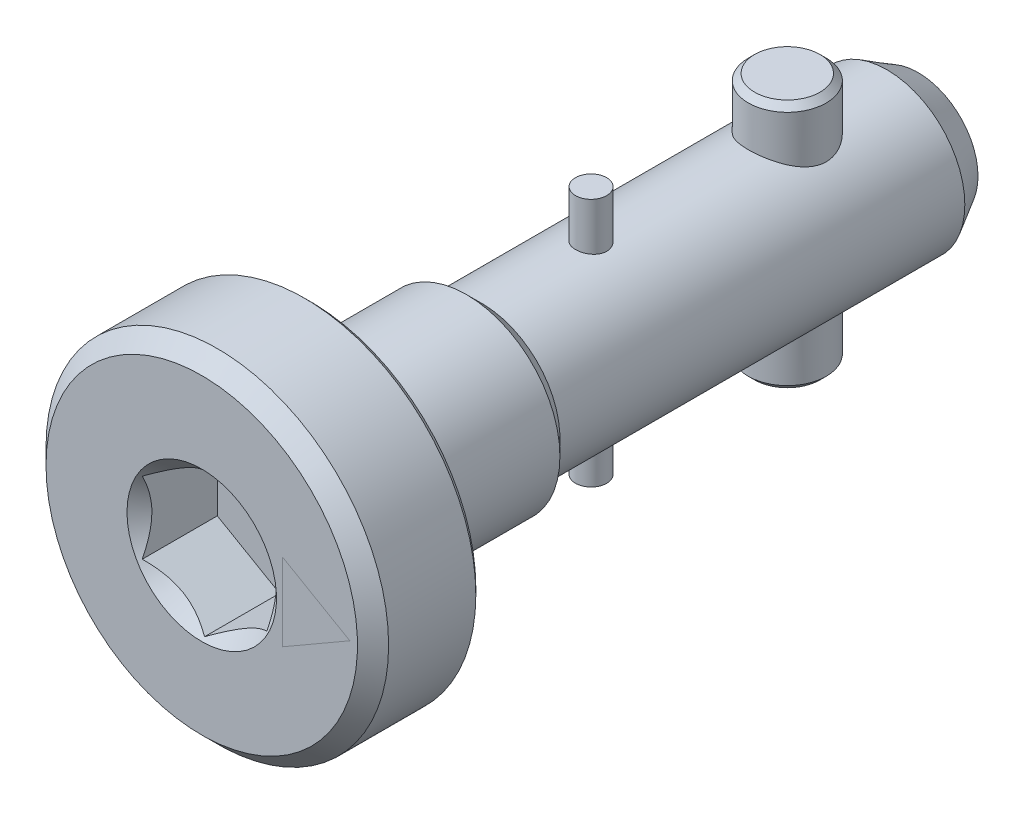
ISO-10303-21;
HEADER;
FILE_DESCRIPTION(('STEP AP214'),'2;1');
FILE_NAME('part.step','',(''),(''),'','','');
FILE_SCHEMA(('AUTOMOTIVE_DESIGN { 1 0 10303 214 1 1 1 1 }'));
ENDSEC;
DATA;
#1=APPLICATION_CONTEXT('core data for automotive mechanical design processes');
#2=APPLICATION_PROTOCOL_DEFINITION('international standard','automotive_design',2000,#1);
#3=PRODUCT_CONTEXT('',#1,'mechanical');
#4=PRODUCT('Part','Part','',(#3));
#5=PRODUCT_RELATED_PRODUCT_CATEGORY('part','',(#4));
#6=PRODUCT_DEFINITION_FORMATION('','',#4);
#7=PRODUCT_DEFINITION_CONTEXT('part definition',#1,'design');
#8=PRODUCT_DEFINITION('design','',#6,#7);
#9=PRODUCT_DEFINITION_SHAPE('','',#8);
#10=(LENGTH_UNIT() NAMED_UNIT(*) SI_UNIT(.MILLI.,.METRE.));
#11=(NAMED_UNIT(*) PLANE_ANGLE_UNIT() SI_UNIT($,.RADIAN.));
#12=(NAMED_UNIT(*) SI_UNIT($,.STERADIAN.) SOLID_ANGLE_UNIT());
#13=UNCERTAINTY_MEASURE_WITH_UNIT(LENGTH_MEASURE(1.E-05),#10,'distance_accuracy_value','');
#14=(GEOMETRIC_REPRESENTATION_CONTEXT(3) GLOBAL_UNCERTAINTY_ASSIGNED_CONTEXT((#13)) GLOBAL_UNIT_ASSIGNED_CONTEXT((#10,
#11,#12)) REPRESENTATION_CONTEXT('',''));
#15=CARTESIAN_POINT('',(0.,0.,0.));
#16=DIRECTION('',(0.,0.,1.));
#17=DIRECTION('',(1.,0.,0.));
#18=AXIS2_PLACEMENT_3D('',#15,#16,#17);
#19=CARTESIAN_POINT('',(0.,0.,-13.83));
#20=DIRECTION('',(0.,0.,1.));
#21=DIRECTION('',(0.,1.,0.));
#22=AXIS2_PLACEMENT_3D('',#19,#20,#21);
#23=CYLINDRICAL_SURFACE('',#22,2.5);
#24=CARTESIAN_POINT('',(0.,0.,-1.33));
#25=DIRECTION('',(0.,0.,1.));
#26=DIRECTION('',(-1.,0.,0.));
#27=AXIS2_PLACEMENT_3D('',#24,#25,#26);
#28=CIRCLE('',#27,2.5);
#29=CARTESIAN_POINT('',(-2.5,0.,-1.33));
#30=VERTEX_POINT('',#29);
#31=EDGE_CURVE('E694',#30,#30,#28,.T.);
#32=ORIENTED_EDGE('',*,*,#31,.F.);
#33=EDGE_LOOP('',(#32));
#34=FACE_BOUND('',#33,.T.);
#35=CARTESIAN_POINT('',(0.,2.5,-9.88));
#36=CARTESIAN_POINT('',(-0.0657149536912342,2.49999641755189,-9.88000412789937));
#37=CARTESIAN_POINT('',(-0.131508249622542,2.49738113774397,-9.8852125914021));
#38=CARTESIAN_POINT('',(-0.261150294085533,2.48717695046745,-9.90581610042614));
#39=CARTESIAN_POINT('',(-0.324995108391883,2.47957859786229,-9.92123049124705));
#40=CARTESIAN_POINT('',(-0.44866693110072,2.46020349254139,-9.96149226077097));
#41=CARTESIAN_POINT('',(-0.508508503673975,2.448442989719,-9.98630298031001));
#42=CARTESIAN_POINT('',(-0.623090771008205,2.42182220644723,-10.0444632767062));
#43=CARTESIAN_POINT('',(-0.677831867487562,2.40696217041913,-10.0778121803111));
#44=CARTESIAN_POINT('',(-0.784384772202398,2.37445322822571,-10.1543965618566));
#45=CARTESIAN_POINT('',(-0.835819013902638,2.3566899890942,-10.1981080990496));
#46=CARTESIAN_POINT('',(-0.930974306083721,2.3207496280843,-10.2931518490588));
#47=CARTESIAN_POINT('',(-0.97468947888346,2.30257220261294,-10.3444898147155));
#48=CARTESIAN_POINT('',(-1.05656500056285,2.26623688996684,-10.4581041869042));
#49=CARTESIAN_POINT('',(-1.09403166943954,2.24818983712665,-10.5209201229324));
#50=CARTESIAN_POINT('',(-1.15771028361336,2.21607473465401,-10.6529591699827));
#51=CARTESIAN_POINT('',(-1.18393026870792,2.20200384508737,-10.7221776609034));
#52=CARTESIAN_POINT('',(-1.22266555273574,2.18072333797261,-10.8608313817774));
#53=CARTESIAN_POINT('',(-1.23590732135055,2.17315339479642,-10.9300055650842));
#54=CARTESIAN_POINT('',(-1.25053374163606,2.1647736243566,-11.0699735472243));
#55=CARTESIAN_POINT('',(-1.25193011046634,2.1639571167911,-11.1407656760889));
#56=CARTESIAN_POINT('',(-1.24335910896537,2.1688866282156,-11.2728575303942));
#57=CARTESIAN_POINT('',(-1.23473069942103,2.17385954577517,-11.3342800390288));
#58=CARTESIAN_POINT('',(-1.20867481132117,2.18845285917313,-11.4546523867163));
#59=CARTESIAN_POINT('',(-1.19124452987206,2.19807473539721,-11.5136014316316));
#60=CARTESIAN_POINT('',(-1.14776222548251,2.22109345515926,-11.6290364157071));
#61=CARTESIAN_POINT('',(-1.121518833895,2.23457300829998,-11.6854329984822));
#62=CARTESIAN_POINT('',(-1.06130210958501,2.26379255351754,-11.7932928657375));
#63=CARTESIAN_POINT('',(-1.02732530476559,2.27953355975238,-11.8447539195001));
#64=CARTESIAN_POINT('',(-0.947582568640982,2.31391447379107,-11.948151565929));
#65=CARTESIAN_POINT('',(-0.900868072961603,2.33266887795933,-11.9993210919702));
#66=CARTESIAN_POINT('',(-0.799444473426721,2.36934529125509,-12.0934192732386));
#67=CARTESIAN_POINT('',(-0.74473157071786,2.38726689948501,-12.1363439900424));
#68=CARTESIAN_POINT('',(-0.625645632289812,2.42127484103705,-12.2146070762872));
#69=CARTESIAN_POINT('',(-0.56094198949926,2.43723730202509,-12.2495005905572));
#70=CARTESIAN_POINT('',(-0.425582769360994,2.46447351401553,-12.3076212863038));
#71=CARTESIAN_POINT('',(-0.354931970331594,2.47575098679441,-12.330857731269));
#72=CARTESIAN_POINT('',(-0.215958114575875,2.49155417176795,-12.3630942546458));
#73=CARTESIAN_POINT('',(-0.147926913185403,2.4965617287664,-12.3731140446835));
#74=CARTESIAN_POINT('',(-0.0109744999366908,2.50091266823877,-12.3818309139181));
#75=CARTESIAN_POINT('',(0.0579462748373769,2.5002587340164,-12.3805333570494));
#76=CARTESIAN_POINT('',(0.189041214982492,2.49363990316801,-12.3672416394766));
#77=CARTESIAN_POINT('',(0.251324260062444,2.48809057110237,-12.3560843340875));
#78=CARTESIAN_POINT('',(0.373008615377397,2.47277714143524,-12.3247024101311));
#79=CARTESIAN_POINT('',(0.432409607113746,2.46301257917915,-12.3044767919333));
#80=CARTESIAN_POINT('',(0.54861076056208,2.43980314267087,-12.2550019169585));
#81=CARTESIAN_POINT('',(0.60528799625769,2.42626102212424,-12.225511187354));
#82=CARTESIAN_POINT('',(0.713076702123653,2.39679967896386,-12.1586155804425));
#83=CARTESIAN_POINT('',(0.764185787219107,2.38087944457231,-12.1212073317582));
#84=CARTESIAN_POINT('',(0.864709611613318,2.3463527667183,-12.0352994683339));
#85=CARTESIAN_POINT('',(0.913465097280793,2.32763606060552,-11.9860714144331));
#86=CARTESIAN_POINT('',(1.00232040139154,2.29077989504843,-11.8800935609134));
#87=CARTESIAN_POINT('',(1.04241423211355,2.27264084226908,-11.8233386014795));
#88=CARTESIAN_POINT('',(1.11463489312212,2.23813990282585,-11.7004454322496));
#89=CARTESIAN_POINT('',(1.14628186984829,2.2219066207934,-11.6339859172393));
#90=CARTESIAN_POINT('',(1.19760353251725,2.19467590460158,-11.4956124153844));
#91=CARTESIAN_POINT('',(1.21729364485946,2.18367172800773,-11.4237055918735));
#92=CARTESIAN_POINT('',(1.2423271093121,2.16951876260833,-11.2838622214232));
#93=CARTESIAN_POINT('',(1.24886624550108,2.16571729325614,-11.2162071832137));
#94=CARTESIAN_POINT('',(1.25086144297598,2.16456693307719,-11.0806911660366));
#95=CARTESIAN_POINT('',(1.2463223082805,2.1672152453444,-11.0128302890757));
#96=CARTESIAN_POINT('',(1.22740765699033,2.17797327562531,-10.885645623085));
#97=CARTESIAN_POINT('',(1.2140103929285,2.18553868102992,-10.8261244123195));
#98=CARTESIAN_POINT('',(1.1789691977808,2.20463770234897,-10.7102398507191));
#99=CARTESIAN_POINT('',(1.15732261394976,2.21617259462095,-10.653877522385));
#100=CARTESIAN_POINT('',(1.10476968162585,2.2428566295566,-10.5417189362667));
#101=CARTESIAN_POINT('',(1.07333892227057,2.25819652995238,-10.4862151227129));
#102=CARTESIAN_POINT('',(1.00268871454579,2.29044164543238,-10.3809068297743));
#103=CARTESIAN_POINT('',(0.963465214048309,2.30734767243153,-10.3311053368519));
#104=CARTESIAN_POINT('',(0.872754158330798,2.34327903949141,-10.232322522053));
#105=CARTESIAN_POINT('',(0.820355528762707,2.36231229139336,-10.1841761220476));
#106=CARTESIAN_POINT('',(0.707693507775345,2.3984719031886,-10.0971712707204));
#107=CARTESIAN_POINT('',(0.647425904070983,2.4155972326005,-10.0583178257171));
#108=CARTESIAN_POINT('',(0.519914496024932,2.44622511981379,-9.99095454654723));
#109=CARTESIAN_POINT('',(0.452624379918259,2.45970120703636,-9.96251978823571));
#110=CARTESIAN_POINT('',(0.313427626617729,2.48126676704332,-9.9177397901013));
#111=CARTESIAN_POINT('',(0.241534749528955,2.48937154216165,-9.90136019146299));
#112=CARTESIAN_POINT('',(0.140752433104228,2.49619327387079,-9.88762823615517));
#113=CARTESIAN_POINT('',(0.112702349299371,2.49761706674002,-9.88477169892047));
#114=CARTESIAN_POINT('',(0.056439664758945,2.49952121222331,-9.880956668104));
#115=CARTESIAN_POINT('',(0.028227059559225,2.50000153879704,-9.879998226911));
#116=CARTESIAN_POINT('',(0.,2.5,-9.88));
#117=B_SPLINE_CURVE_WITH_KNOTS('',3,(#35,#36,#37,#38,#39,#40,#41,#42,#43,#44,#45,#46,#47,#48,
#49,#50,#51,#52,#53,#54,#55,#56,#57,#58,#59,#60,#61,#62,#63,#64,#65,#66,#67,#68,#69,#70,#71,#72,
#73,#74,#75,#76,#77,#78,#79,#80,#81,#82,#83,#84,#85,#86,#87,#88,#89,#90,#91,#92,#93,#94,#95,#96,
#97,#98,#99,#100,#101,#102,#103,#104,#105,#106,#107,#108,#109,#110,#111,#112,#113,#114,#115,
#116),.UNSPECIFIED.,.T.,.F.,(4,2,2,2,2,2,2,2,2,2,2,2,2,2,2,2,2,2,2,2,2,2,2,2,2,2,2,2,2,2,2,2,2,
2,2,2,2,2,2,2,4),(0.,0.197030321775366,0.394435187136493,0.591077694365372,0.787704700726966,
0.996227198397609,1.20490779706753,1.42977158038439,1.65447434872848,1.86572515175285,
2.07676696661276,2.2625714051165,2.44843504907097,2.63862800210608,2.82890651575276,
3.04331176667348,3.25781918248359,3.48228777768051,3.7065777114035,3.91229113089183,
4.11790705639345,4.30758633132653,4.49728652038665,4.69241070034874,4.88761813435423,
5.10199513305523,5.3165198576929,5.54143352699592,5.76605639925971,5.96911634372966,
6.17208824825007,6.35572412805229,6.53941910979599,6.73545570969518,6.93159451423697,
7.15156553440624,7.37165479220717,7.59330017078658,7.81431135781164,7.89894100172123,
7.98357298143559),.UNSPECIFIED.);
#118=CARTESIAN_POINT('',(0.,2.5,-9.88));
#119=VERTEX_POINT('',#118);
#120=EDGE_CURVE('E140',#119,#119,#117,.T.);
#121=ORIENTED_EDGE('',*,*,#120,.T.);
#122=EDGE_LOOP('',(#121));
#123=FACE_BOUND('',#122,.T.);
#124=CARTESIAN_POINT('',(0.,-2.5,-9.88));
#125=CARTESIAN_POINT('',(0.0657149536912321,-2.49999641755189,-9.88000412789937));
#126=CARTESIAN_POINT('',(0.131508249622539,-2.49738113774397,-9.8852125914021));
#127=CARTESIAN_POINT('',(0.261150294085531,-2.48717695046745,-9.90581610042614));
#128=CARTESIAN_POINT('',(0.324995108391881,-2.47957859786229,-9.92123049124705));
#129=CARTESIAN_POINT('',(0.448666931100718,-2.46020349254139,-9.96149226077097));
#130=CARTESIAN_POINT('',(0.508508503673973,-2.448442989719,-9.98630298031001));
#131=CARTESIAN_POINT('',(0.623090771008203,-2.42182220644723,-10.0444632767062));
#132=CARTESIAN_POINT('',(0.67783186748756,-2.40696217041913,-10.0778121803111));
#133=CARTESIAN_POINT('',(0.784384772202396,-2.37445322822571,-10.1543965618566));
#134=CARTESIAN_POINT('',(0.835819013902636,-2.3566899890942,-10.1981080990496));
#135=CARTESIAN_POINT('',(0.93097430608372,-2.3207496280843,-10.2931518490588));
#136=CARTESIAN_POINT('',(0.97468947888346,-2.30257220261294,-10.3444898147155));
#137=CARTESIAN_POINT('',(1.05656500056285,-2.26623688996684,-10.4581041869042));
#138=CARTESIAN_POINT('',(1.09403166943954,-2.24818983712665,-10.5209201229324));
#139=CARTESIAN_POINT('',(1.15771028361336,-2.21607473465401,-10.6529591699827));
#140=CARTESIAN_POINT('',(1.18393026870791,-2.20200384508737,-10.7221776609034));
#141=CARTESIAN_POINT('',(1.22266555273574,-2.18072333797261,-10.8608313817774));
#142=CARTESIAN_POINT('',(1.23590732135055,-2.17315339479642,-10.9300055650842));
#143=CARTESIAN_POINT('',(1.25053374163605,-2.1647736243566,-11.0699735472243));
#144=CARTESIAN_POINT('',(1.25193011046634,-2.1639571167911,-11.1407656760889));
#145=CARTESIAN_POINT('',(1.24335910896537,-2.1688866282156,-11.2728575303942));
#146=CARTESIAN_POINT('',(1.23473069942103,-2.17385954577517,-11.3342800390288));
#147=CARTESIAN_POINT('',(1.20867481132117,-2.18845285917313,-11.4546523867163));
#148=CARTESIAN_POINT('',(1.19124452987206,-2.19807473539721,-11.5136014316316));
#149=CARTESIAN_POINT('',(1.1477622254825,-2.22109345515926,-11.6290364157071));
#150=CARTESIAN_POINT('',(1.121518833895,-2.23457300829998,-11.6854329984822));
#151=CARTESIAN_POINT('',(1.06130210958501,-2.26379255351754,-11.7932928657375));
#152=CARTESIAN_POINT('',(1.02732530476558,-2.27953355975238,-11.8447539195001));
#153=CARTESIAN_POINT('',(0.947582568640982,-2.31391447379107,-11.948151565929));
#154=CARTESIAN_POINT('',(0.900868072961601,-2.33266887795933,-11.9993210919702));
#155=CARTESIAN_POINT('',(0.799444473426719,-2.36934529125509,-12.0934192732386));
#156=CARTESIAN_POINT('',(0.744731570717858,-2.38726689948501,-12.1363439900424));
#157=CARTESIAN_POINT('',(0.62564563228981,-2.42127484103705,-12.2146070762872));
#158=CARTESIAN_POINT('',(0.560941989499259,-2.43723730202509,-12.2495005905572));
#159=CARTESIAN_POINT('',(0.425582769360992,-2.46447351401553,-12.3076212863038));
#160=CARTESIAN_POINT('',(0.354931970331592,-2.47575098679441,-12.330857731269));
#161=CARTESIAN_POINT('',(0.215958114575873,-2.49155417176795,-12.3630942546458));
#162=CARTESIAN_POINT('',(0.147926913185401,-2.4965617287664,-12.3731140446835));
#163=CARTESIAN_POINT('',(0.0109744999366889,-2.50091266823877,-12.3818309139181));
#164=CARTESIAN_POINT('',(-0.0579462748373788,-2.5002587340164,-12.3805333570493));
#165=CARTESIAN_POINT('',(-0.189041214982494,-2.49363990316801,-12.3672416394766));
#166=CARTESIAN_POINT('',(-0.251324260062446,-2.48809057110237,-12.3560843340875));
#167=CARTESIAN_POINT('',(-0.373008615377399,-2.47277714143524,-12.3247024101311));
#168=CARTESIAN_POINT('',(-0.432409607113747,-2.46301257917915,-12.3044767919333));
#169=CARTESIAN_POINT('',(-0.548610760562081,-2.43980314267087,-12.2550019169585));
#170=CARTESIAN_POINT('',(-0.605287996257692,-2.42626102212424,-12.225511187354));
#171=CARTESIAN_POINT('',(-0.713076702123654,-2.39679967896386,-12.1586155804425));
#172=CARTESIAN_POINT('',(-0.764185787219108,-2.38087944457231,-12.1212073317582));
#173=CARTESIAN_POINT('',(-0.864709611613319,-2.3463527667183,-12.0352994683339));
#174=CARTESIAN_POINT('',(-0.913465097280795,-2.32763606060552,-11.9860714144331));
#175=CARTESIAN_POINT('',(-1.00232040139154,-2.29077989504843,-11.8800935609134));
#176=CARTESIAN_POINT('',(-1.04241423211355,-2.27264084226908,-11.8233386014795));
#177=CARTESIAN_POINT('',(-1.11463489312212,-2.23813990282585,-11.7004454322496));
#178=CARTESIAN_POINT('',(-1.14628186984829,-2.2219066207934,-11.6339859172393));
#179=CARTESIAN_POINT('',(-1.19760353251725,-2.19467590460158,-11.4956124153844));
#180=CARTESIAN_POINT('',(-1.21729364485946,-2.18367172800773,-11.4237055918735));
#181=CARTESIAN_POINT('',(-1.2423271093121,-2.16951876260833,-11.2838622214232));
#182=CARTESIAN_POINT('',(-1.24886624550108,-2.16571729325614,-11.2162071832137));
#183=CARTESIAN_POINT('',(-1.25086144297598,-2.16456693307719,-11.0806911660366));
#184=CARTESIAN_POINT('',(-1.2463223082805,-2.16721524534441,-11.0128302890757));
#185=CARTESIAN_POINT('',(-1.22740765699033,-2.17797327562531,-10.885645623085));
#186=CARTESIAN_POINT('',(-1.2140103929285,-2.18553868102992,-10.8261244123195));
#187=CARTESIAN_POINT('',(-1.17896919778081,-2.20463770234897,-10.7102398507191));
#188=CARTESIAN_POINT('',(-1.15732261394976,-2.21617259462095,-10.653877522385));
#189=CARTESIAN_POINT('',(-1.10476968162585,-2.2428566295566,-10.5417189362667));
#190=CARTESIAN_POINT('',(-1.07333892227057,-2.25819652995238,-10.4862151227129));
#191=CARTESIAN_POINT('',(-1.00268871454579,-2.29044164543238,-10.3809068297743));
#192=CARTESIAN_POINT('',(-0.96346521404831,-2.30734767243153,-10.3311053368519));
#193=CARTESIAN_POINT('',(-0.872754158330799,-2.34327903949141,-10.232322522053));
#194=CARTESIAN_POINT('',(-0.820355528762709,-2.36231229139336,-10.1841761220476));
#195=CARTESIAN_POINT('',(-0.707693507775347,-2.3984719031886,-10.0971712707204));
#196=CARTESIAN_POINT('',(-0.647425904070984,-2.4155972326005,-10.0583178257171));
#197=CARTESIAN_POINT('',(-0.519914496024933,-2.44622511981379,-9.99095454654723));
#198=CARTESIAN_POINT('',(-0.45262437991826,-2.45970120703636,-9.96251978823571));
#199=CARTESIAN_POINT('',(-0.313427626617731,-2.48126676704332,-9.9177397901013));
#200=CARTESIAN_POINT('',(-0.241534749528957,-2.48937154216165,-9.90136019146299));
#201=CARTESIAN_POINT('',(-0.14075243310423,-2.49619327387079,-9.88762823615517));
#202=CARTESIAN_POINT('',(-0.112702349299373,-2.49761706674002,-9.88477169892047));
#203=CARTESIAN_POINT('',(-0.0564396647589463,-2.49952121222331,-9.880956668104));
#204=CARTESIAN_POINT('',(-0.0282270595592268,-2.50000153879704,-9.879998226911));
#205=CARTESIAN_POINT('',(0.,-2.5,-9.88));
#206=B_SPLINE_CURVE_WITH_KNOTS('',3,(#124,#125,#126,#127,#128,#129,#130,#131,#132,#133,#134,
#135,#136,#137,#138,#139,#140,#141,#142,#143,#144,#145,#146,#147,#148,#149,#150,#151,#152,#153,
#154,#155,#156,#157,#158,#159,#160,#161,#162,#163,#164,#165,#166,#167,#168,#169,#170,#171,#172,
#173,#174,#175,#176,#177,#178,#179,#180,#181,#182,#183,#184,#185,#186,#187,#188,#189,#190,#191,
#192,#193,#194,#195,#196,#197,#198,#199,#200,#201,#202,#203,#204,#205),.UNSPECIFIED.,.T.,.F.,(4,
2,2,2,2,2,2,2,2,2,2,2,2,2,2,2,2,2,2,2,2,2,2,2,2,2,2,2,2,2,2,2,2,2,2,2,2,2,2,2,4),(0.,
0.197030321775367,0.394435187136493,0.591077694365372,0.787704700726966,0.996227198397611,
1.20490779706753,1.42977158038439,1.65447434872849,1.86572515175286,2.07676696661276,
2.2625714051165,2.44843504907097,2.63862800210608,2.82890651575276,3.04331176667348,
3.25781918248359,3.48228777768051,3.7065777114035,3.91229113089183,4.11790705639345,
4.30758633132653,4.49728652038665,4.69241070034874,4.88761813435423,5.10199513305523,
5.3165198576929,5.54143352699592,5.7660563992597,5.96911634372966,6.17208824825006,
6.35572412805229,6.53941910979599,6.73545570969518,6.93159451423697,7.15156553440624,
7.37165479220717,7.59330017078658,7.81431135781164,7.89894100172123,7.98357298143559),.UNSPECIFIED.);
#207=CARTESIAN_POINT('',(0.,-2.5,-9.88));
#208=VERTEX_POINT('',#207);
#209=EDGE_CURVE('E149',#208,#208,#206,.T.);
#210=ORIENTED_EDGE('',*,*,#209,.T.);
#211=EDGE_LOOP('',(#210));
#212=FACE_BOUND('',#211,.T.);
#213=CARTESIAN_POINT('',(0.,0.,-14.33));
#214=DIRECTION('',(0.,0.,-1.));
#215=DIRECTION('',(1.,0.,0.));
#216=AXIS2_PLACEMENT_3D('',#213,#214,#215);
#217=CIRCLE('',#216,2.5);
#218=CARTESIAN_POINT('',(2.5,0.,-14.33));
#219=VERTEX_POINT('',#218);
#220=EDGE_CURVE('E229',#219,#219,#217,.F.);
#221=ORIENTED_EDGE('',*,*,#220,.T.);
#222=EDGE_LOOP('',(#221));
#223=FACE_BOUND('',#222,.T.);
#224=CARTESIAN_POINT('',(-0.08321374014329,-2.49861471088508,-5.32302684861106));
#225=CARTESIAN_POINT('',(-0.0559692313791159,-2.49952156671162,-5.32762424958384));
#226=CARTESIAN_POINT('',(-0.0283167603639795,-2.49999240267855,-5.32996232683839));
#227=CARTESIAN_POINT('',(0.0270070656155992,-2.50000742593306,-5.33003681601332));
#228=CARTESIAN_POINT('',(0.054678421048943,-2.49955100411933,-5.32777020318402));
#229=CARTESIAN_POINT('',(0.109222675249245,-2.49776191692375,-5.31870657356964));
#230=CARTESIAN_POINT('',(0.136096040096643,-2.49642977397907,-5.3119122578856));
#231=CARTESIAN_POINT('',(0.188309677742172,-2.49303522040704,-5.29400577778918));
#232=CARTESIAN_POINT('',(0.213650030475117,-2.49097284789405,-5.28289383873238));
#233=CARTESIAN_POINT('',(0.262305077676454,-2.48632227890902,-5.25657576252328));
#234=CARTESIAN_POINT('',(0.285602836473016,-2.48373018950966,-5.24133902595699));
#235=CARTESIAN_POINT('',(0.32933872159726,-2.47831040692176,-5.20723365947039));
#236=CARTESIAN_POINT('',(0.349776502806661,-2.47548268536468,-5.18836459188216));
#237=CARTESIAN_POINT('',(0.387562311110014,-2.46985164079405,-5.14715867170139));
#238=CARTESIAN_POINT('',(0.404853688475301,-2.46704949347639,-5.12476965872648));
#239=CARTESIAN_POINT('',(0.435436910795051,-2.46183594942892,-5.07736658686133));
#240=CARTESIAN_POINT('',(0.448728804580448,-2.45942454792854,-5.05235256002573));
#241=CARTESIAN_POINT('',(0.470895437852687,-2.45527699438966,-5.00044669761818));
#242=CARTESIAN_POINT('',(0.479779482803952,-2.45353942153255,-4.97355895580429));
#243=CARTESIAN_POINT('',(0.492890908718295,-2.45093937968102,-4.91863128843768));
#244=CARTESIAN_POINT('',(0.497118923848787,-2.45007679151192,-4.89059152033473));
#245=CARTESIAN_POINT('',(0.500747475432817,-2.44933772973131,-4.83469942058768));
#246=CARTESIAN_POINT('',(0.500233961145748,-2.44944369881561,-4.8068528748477));
#247=CARTESIAN_POINT('',(0.494601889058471,-2.45058708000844,-4.7516501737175));
#248=CARTESIAN_POINT('',(0.489483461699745,-2.45162446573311,-4.72429400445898));
#249=CARTESIAN_POINT('',(0.474845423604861,-2.45450127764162,-4.67099894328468));
#250=CARTESIAN_POINT('',(0.46535070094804,-2.45633616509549,-4.64505295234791));
#251=CARTESIAN_POINT('',(0.442250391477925,-2.46059989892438,-4.59511344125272));
#252=CARTESIAN_POINT('',(0.428644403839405,-2.46302880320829,-4.57112011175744));
#253=CARTESIAN_POINT('',(0.397457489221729,-2.46825456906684,-4.52535895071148));
#254=CARTESIAN_POINT('',(0.379817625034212,-2.47105659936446,-4.50363187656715));
#255=CARTESIAN_POINT('',(0.341168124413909,-2.47668829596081,-4.46341823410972));
#256=CARTESIAN_POINT('',(0.32015819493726,-2.47951796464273,-4.444931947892));
#257=CARTESIAN_POINT('',(0.275043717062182,-2.48492910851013,-4.41149179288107));
#258=CARTESIAN_POINT('',(0.250903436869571,-2.4875069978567,-4.39658548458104));
#259=CARTESIAN_POINT('',(0.200407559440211,-2.49208318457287,-4.37104778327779));
#260=CARTESIAN_POINT('',(0.17405211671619,-2.49408152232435,-4.3604160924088));
#261=CARTESIAN_POINT('',(0.120135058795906,-2.49725637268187,-4.34383604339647));
#262=CARTESIAN_POINT('',(0.0925873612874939,-2.49844054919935,-4.33784394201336));
#263=CARTESIAN_POINT('',(0.0368543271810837,-2.49988365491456,-4.33056902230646));
#264=CARTESIAN_POINT('',(0.00866906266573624,-2.50014268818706,-4.32928567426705));
#265=CARTESIAN_POINT('',(-0.0470451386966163,-2.49971005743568,-4.33145085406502));
#266=CARTESIAN_POINT('',(-0.074577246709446,-2.49903395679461,-4.33482191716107));
#267=CARTESIAN_POINT('',(-0.128674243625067,-2.49683321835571,-4.34605151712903));
#268=CARTESIAN_POINT('',(-0.155239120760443,-2.49530857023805,-4.35391010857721));
#269=CARTESIAN_POINT('',(-0.206713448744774,-2.49157325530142,-4.3738933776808));
#270=CARTESIAN_POINT('',(-0.231619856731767,-2.48936136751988,-4.38602565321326));
#271=CARTESIAN_POINT('',(-0.279062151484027,-2.48449064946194,-4.41420467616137));
#272=CARTESIAN_POINT('',(-0.301597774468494,-2.48183176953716,-4.43025185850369));
#273=CARTESIAN_POINT('',(-0.344074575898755,-2.4763037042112,-4.46613342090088));
#274=CARTESIAN_POINT('',(-0.363964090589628,-2.47343167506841,-4.48602855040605));
#275=CARTESIAN_POINT('',(-0.400141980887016,-2.46783758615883,-4.52888082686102));
#276=CARTESIAN_POINT('',(-0.416430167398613,-2.46511553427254,-4.55183813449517));
#277=CARTESIAN_POINT('',(-0.445044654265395,-2.46011148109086,-4.60036154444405));
#278=CARTESIAN_POINT('',(-0.457343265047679,-2.45783259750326,-4.62594432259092));
#279=CARTESIAN_POINT('',(-0.477451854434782,-2.45400596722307,-4.67886828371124));
#280=CARTESIAN_POINT('',(-0.485262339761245,-2.45245813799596,-4.70620926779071));
#281=CARTESIAN_POINT('',(-0.496064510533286,-2.45029594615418,-4.76144264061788));
#282=CARTESIAN_POINT('',(-0.499125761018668,-2.44966811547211,-4.78932089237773));
#283=CARTESIAN_POINT('',(-0.500549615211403,-2.44937762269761,-4.8452008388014));
#284=CARTESIAN_POINT('',(-0.498912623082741,-2.44971487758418,-4.87320252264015));
#285=CARTESIAN_POINT('',(-0.491048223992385,-2.45130313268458,-4.92813981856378));
#286=CARTESIAN_POINT('',(-0.484882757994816,-2.45254180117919,-4.95508469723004));
#287=CARTESIAN_POINT('',(-0.468223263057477,-2.45577653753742,-5.00755190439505));
#288=CARTESIAN_POINT('',(-0.457729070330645,-2.45777263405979,-5.0330741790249));
#289=CARTESIAN_POINT('',(-0.432605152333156,-2.46231933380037,-5.08223344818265));
#290=CARTESIAN_POINT('',(-0.417938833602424,-2.46487479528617,-5.10585127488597));
#291=CARTESIAN_POINT('',(-0.384916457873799,-2.47024661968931,-5.15032267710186));
#292=CARTESIAN_POINT('',(-0.366559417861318,-2.47306305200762,-5.17117551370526));
#293=CARTESIAN_POINT('',(-0.326293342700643,-2.47869978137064,-5.20990374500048));
#294=CARTESIAN_POINT('',(-0.304327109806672,-2.48151926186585,-5.22771980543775));
#295=CARTESIAN_POINT('',(-0.257689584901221,-2.48679405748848,-5.25940608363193));
#296=CARTESIAN_POINT('',(-0.233020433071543,-2.48924965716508,-5.27327939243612));
#297=CARTESIAN_POINT('',(-0.18762154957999,-2.49302847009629,-5.29397064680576));
#298=CARTESIAN_POINT('',(-0.167302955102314,-2.4944822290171,-5.30167849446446));
#299=CARTESIAN_POINT('',(-0.125811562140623,-2.49691876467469,-5.3143988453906));
#300=CARTESIAN_POINT('',(-0.104638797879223,-2.4979015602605,-5.31941145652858));
#301=CARTESIAN_POINT('',(-0.08321374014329,-2.49861471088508,-5.32302684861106));
#302=B_SPLINE_CURVE_WITH_KNOTS('',3,(#224,#225,#226,#227,#228,#229,#230,#231,#232,#233,#234,
#235,#236,#237,#238,#239,#240,#241,#242,#243,#244,#245,#246,#247,#248,#249,#250,#251,#252,#253,
#254,#255,#256,#257,#258,#259,#260,#261,#262,#263,#264,#265,#266,#267,#268,#269,#270,#271,#272,
#273,#274,#275,#276,#277,#278,#279,#280,#281,#282,#283,#284,#285,#286,#287,#288,#289,#290,#291,
#292,#293,#294,#295,#296,#297,#298,#299,#300,#301),.UNSPECIFIED.,.T.,.F.,(4,2,2,2,2,2,2,2,2,2,2,
2,2,2,2,2,2,2,2,2,2,2,2,2,2,2,2,2,2,2,2,2,2,2,2,2,2,2,4),(0.,0.0828553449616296,
0.16576513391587,0.248625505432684,0.331481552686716,0.41496995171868,0.498468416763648,
0.583346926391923,0.668224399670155,0.752921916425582,0.837607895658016,0.920761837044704,
1.003913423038,1.08659785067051,1.16929034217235,1.25327841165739,1.33727378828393,
1.42232996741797,1.50738021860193,1.59161848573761,1.67584727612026,1.75869099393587,
1.84153571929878,1.92452847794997,2.0075304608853,2.09196924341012,2.17641245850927,
2.26142979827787,2.34643753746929,2.43018794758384,2.51393115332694,2.59654975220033,
2.67917147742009,2.76254148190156,2.84593372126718,2.93080425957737,3.01560807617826,
3.08076805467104,3.14592542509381),.UNSPECIFIED.);
#303=CARTESIAN_POINT('',(-0.08321374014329,-2.49861471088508,-5.32302684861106));
#304=VERTEX_POINT('',#303);
#305=EDGE_CURVE('E27',#304,#304,#302,.T.);
#306=ORIENTED_EDGE('',*,*,#305,.F.);
#307=EDGE_LOOP('',(#306));
#308=FACE_BOUND('',#307,.T.);
#309=CARTESIAN_POINT('',(0.,2.5,-5.33));
#310=CARTESIAN_POINT('',(-0.0277884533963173,2.49999948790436,-5.32999897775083));
#311=CARTESIAN_POINT('',(-0.0555898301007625,2.49953192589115,-5.32767557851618));
#312=CARTESIAN_POINT('',(-0.110406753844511,2.49771182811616,-5.31845074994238));
#313=CARTESIAN_POINT('',(-0.137421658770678,2.49635858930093,-5.31154568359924));
#314=CARTESIAN_POINT('',(-0.189865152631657,2.49291824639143,-5.2933793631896));
#315=CARTESIAN_POINT('',(-0.215295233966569,2.49083184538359,-5.28212228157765));
#316=CARTESIAN_POINT('',(-0.263903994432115,2.48615199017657,-5.25558387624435));
#317=CARTESIAN_POINT('',(-0.287082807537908,2.48355856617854,-5.2403027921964));
#318=CARTESIAN_POINT('',(-0.330846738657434,2.47811082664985,-5.20593075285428));
#319=CARTESIAN_POINT('',(-0.351396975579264,2.47525372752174,-5.1867958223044));
#320=CARTESIAN_POINT('',(-0.389018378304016,2.46962090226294,-5.14535379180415));
#321=CARTESIAN_POINT('',(-0.406089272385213,2.46684518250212,-5.12304644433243));
#322=CARTESIAN_POINT('',(-0.436415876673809,2.46166220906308,-5.07564190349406));
#323=CARTESIAN_POINT('',(-0.449635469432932,2.45925853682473,-5.05052117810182));
#324=CARTESIAN_POINT('',(-0.471652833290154,2.45513134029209,-4.99835909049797));
#325=CARTESIAN_POINT('',(-0.48045104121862,2.45340774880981,-4.97131791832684));
#326=CARTESIAN_POINT('',(-0.493262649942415,2.45086402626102,-4.91645781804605));
#327=CARTESIAN_POINT('',(-0.497337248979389,2.45003235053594,-4.8886537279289));
#328=CARTESIAN_POINT('',(-0.500776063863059,2.44933187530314,-4.83274508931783));
#329=CARTESIAN_POINT('',(-0.50014076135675,2.4494629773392,-4.80464057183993));
#330=CARTESIAN_POINT('',(-0.494227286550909,2.45066275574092,-4.7493766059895));
#331=CARTESIAN_POINT('',(-0.489019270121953,2.45171726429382,-4.72220929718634));
#332=CARTESIAN_POINT('',(-0.474218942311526,2.45462273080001,-4.6691419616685));
#333=CARTESIAN_POINT('',(-0.464626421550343,2.4564737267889,-4.64324199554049));
#334=CARTESIAN_POINT('',(-0.441262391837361,2.46077809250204,-4.5932423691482));
#335=CARTESIAN_POINT('',(-0.427463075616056,2.46323544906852,-4.56915606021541));
#336=CARTESIAN_POINT('',(-0.396096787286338,2.46847309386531,-4.52361457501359));
#337=CARTESIAN_POINT('',(-0.378529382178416,2.47125341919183,-4.50215970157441));
#338=CARTESIAN_POINT('',(-0.339749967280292,2.47688510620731,-4.46208529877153));
#339=CARTESIAN_POINT('',(-0.318478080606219,2.47973684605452,-4.44352371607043));
#340=CARTESIAN_POINT('',(-0.273092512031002,2.48514424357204,-4.41022307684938));
#341=CARTESIAN_POINT('',(-0.248978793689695,2.48769989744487,-4.3954840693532));
#342=CARTESIAN_POINT('',(-0.198529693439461,2.49223345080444,-4.37023624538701));
#343=CARTESIAN_POINT('',(-0.172190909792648,2.49421044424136,-4.35973405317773));
#344=CARTESIAN_POINT('',(-0.118074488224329,2.49735704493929,-4.34331976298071));
#345=CARTESIAN_POINT('',(-0.0902970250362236,2.49852675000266,-4.33740710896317));
#346=CARTESIAN_POINT('',(-0.034589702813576,2.49991335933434,-4.33042177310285));
#347=CARTESIAN_POINT('',(-0.00667016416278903,2.50014587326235,-4.32926979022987));
#348=CARTESIAN_POINT('',(0.048962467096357,2.49967525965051,-4.33162492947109));
#349=CARTESIAN_POINT('',(0.0766755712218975,2.49897218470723,-4.33513178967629));
#350=CARTESIAN_POINT('',(0.13085282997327,2.49671916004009,-4.34663918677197));
#351=CARTESIAN_POINT('',(0.157325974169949,2.49517688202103,-4.35459903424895));
#352=CARTESIAN_POINT('',(0.208561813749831,2.49141776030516,-4.37474199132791));
#353=CARTESIAN_POINT('',(0.233324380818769,2.48920086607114,-4.38692541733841));
#354=CARTESIAN_POINT('',(0.280770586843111,2.48429955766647,-4.41534124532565));
#355=CARTESIAN_POINT('',(0.303425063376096,2.48160975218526,-4.43162139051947));
#356=CARTESIAN_POINT('',(0.345709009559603,2.47607367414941,-4.46770459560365));
#357=CARTESIAN_POINT('',(0.365338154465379,2.47322738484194,-4.48750803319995));
#358=CARTESIAN_POINT('',(0.401320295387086,2.46764651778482,-4.53043667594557));
#359=CARTESIAN_POINT('',(0.417618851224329,2.46491430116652,-4.55360787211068));
#360=CARTESIAN_POINT('',(0.446092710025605,2.45992095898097,-4.60240568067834));
#361=CARTESIAN_POINT('',(0.458268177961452,2.45765981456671,-4.62803219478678));
#362=CARTESIAN_POINT('',(0.47807592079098,2.45388370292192,-4.68088412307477));
#363=CARTESIAN_POINT('',(0.485731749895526,2.45236487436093,-4.70810042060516));
#364=CARTESIAN_POINT('',(0.496354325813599,2.45023718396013,-4.76346672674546));
#365=CARTESIAN_POINT('',(0.499321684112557,2.44962820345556,-4.79161661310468));
#366=CARTESIAN_POINT('',(0.500460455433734,2.4493957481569,-4.84750443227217));
#367=CARTESIAN_POINT('',(0.498717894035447,2.4497545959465,-4.87524057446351));
#368=CARTESIAN_POINT('',(0.490676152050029,2.45137786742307,-4.93001582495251));
#369=CARTESIAN_POINT('',(0.484377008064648,2.45264228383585,-4.9570549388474));
#370=CARTESIAN_POINT('',(0.467439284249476,2.45592632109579,-5.00961385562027));
#371=CARTESIAN_POINT('',(0.456811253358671,2.45794410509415,-5.03513718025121));
#372=CARTESIAN_POINT('',(0.431527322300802,2.46250857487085,-5.08405186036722));
#373=CARTESIAN_POINT('',(0.416871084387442,2.46505530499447,-5.10744303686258));
#374=CARTESIAN_POINT('',(0.383652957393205,2.47044480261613,-5.15185778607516));
#375=CARTESIAN_POINT('',(0.365028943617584,2.4732918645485,-5.1728343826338));
#376=CARTESIAN_POINT('',(0.324532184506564,2.47893040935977,-5.21139310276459));
#377=CARTESIAN_POINT('',(0.302658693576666,2.48172187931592,-5.22897444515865));
#378=CARTESIAN_POINT('',(0.256008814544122,2.48696916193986,-5.26041732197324));
#379=CARTESIAN_POINT('',(0.231204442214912,2.48942115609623,-5.27423800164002));
#380=CARTESIAN_POINT('',(0.179583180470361,2.493675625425,-5.2974930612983));
#381=CARTESIAN_POINT('',(0.152768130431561,2.49547868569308,-5.30693139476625));
#382=CARTESIAN_POINT('',(0.104910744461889,2.49788186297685,-5.31932597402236));
#383=CARTESIAN_POINT('',(0.0841408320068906,2.49867151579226,-5.32332159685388));
#384=CARTESIAN_POINT('',(0.0422497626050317,2.49973077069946,-5.32865895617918));
#385=CARTESIAN_POINT('',(0.0211286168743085,2.50000038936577,-5.33000077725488));
#386=CARTESIAN_POINT('',(0.,2.5,-5.33));
#387=B_SPLINE_CURVE_WITH_KNOTS('',3,(#309,#310,#311,#312,#313,#314,#315,#316,#317,#318,#319,
#320,#321,#322,#323,#324,#325,#326,#327,#328,#329,#330,#331,#332,#333,#334,#335,#336,#337,#338,
#339,#340,#341,#342,#343,#344,#345,#346,#347,#348,#349,#350,#351,#352,#353,#354,#355,#356,#357,
#358,#359,#360,#361,#362,#363,#364,#365,#366,#367,#368,#369,#370,#371,#372,#373,#374,#375,#376,
#377,#378,#379,#380,#381,#382,#383,#384,#385,#386),.UNSPECIFIED.,.T.,.F.,(4,2,2,2,2,2,2,2,2,2,2,
2,2,2,2,2,2,2,2,2,2,2,2,2,2,2,2,2,2,2,2,2,2,2,2,2,2,2,4),(0.,0.0832880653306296,
0.166642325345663,0.249916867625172,0.33318645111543,0.417466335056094,0.501752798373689,
0.586805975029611,0.671850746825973,0.755780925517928,0.839702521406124,0.922358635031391,
1.00501869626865,1.08823745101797,1.17146577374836,1.25619126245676,1.3409178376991,
1.42577637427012,1.51062462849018,1.59405367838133,1.67747803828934,1.76015226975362,
1.84283269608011,1.9265253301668,2.01022694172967,2.09520314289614,2.18017594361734,
2.26470190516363,2.34921684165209,2.43219861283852,2.51517971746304,2.59795980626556,
2.68074683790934,2.76494038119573,2.84915327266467,2.9342474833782,3.0192647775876,
3.08259387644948,3.14592095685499),.UNSPECIFIED.);
#388=CARTESIAN_POINT('',(0.,2.5,-5.33));
#389=VERTEX_POINT('',#388);
#390=EDGE_CURVE('E9',#389,#389,#387,.T.);
#391=ORIENTED_EDGE('',*,*,#390,.F.);
#392=EDGE_LOOP('',(#391));
#393=FACE_BOUND('',#392,.T.);
#394=ADVANCED_FACE('F14',(#34,#123,#212,#223,#308,#393),#23,.T.);
#395=CARTESIAN_POINT('',(0.,-4.,-11.13));
#396=DIRECTION('',(0.,1.,0.));
#397=DIRECTION('',(0.,0.,1.));
#398=AXIS2_PLACEMENT_3D('',#395,#396,#397);
#399=CYLINDRICAL_SURFACE('',#398,1.25);
#400=ORIENTED_EDGE('',*,*,#209,.F.);
#401=EDGE_LOOP('',(#400));
#402=FACE_BOUND('',#401,.T.);
#403=CARTESIAN_POINT('',(0.,-3.8,-11.13));
#404=DIRECTION('',(0.,-1.,0.));
#405=DIRECTION('',(0.,0.,-1.));
#406=AXIS2_PLACEMENT_3D('',#403,#404,#405);
#407=CIRCLE('',#406,1.25);
#408=CARTESIAN_POINT('',(0.,-3.8,-12.38));
#409=VERTEX_POINT('',#408);
#410=EDGE_CURVE('E175',#409,#409,#407,.F.);
#411=ORIENTED_EDGE('',*,*,#410,.T.);
#412=EDGE_LOOP('',(#411));
#413=FACE_BOUND('',#412,.T.);
#414=ADVANCED_FACE('F160',(#402,#413),#399,.T.);
#415=CARTESIAN_POINT('',(0.,-4.,-11.13));
#416=DIRECTION('',(0.,-1.,0.));
#417=DIRECTION('',(0.,0.,-1.));
#418=AXIS2_PLACEMENT_3D('',#415,#416,#417);
#419=PLANE('',#418);
#420=CARTESIAN_POINT('',(0.,-4.,-11.13));
#421=DIRECTION('',(0.,-1.,0.));
#422=DIRECTION('',(0.,0.,-1.));
#423=AXIS2_PLACEMENT_3D('',#420,#421,#422);
#424=CIRCLE('',#423,1.05);
#425=CARTESIAN_POINT('',(0.,-4.,-12.18));
#426=VERTEX_POINT('',#425);
#427=EDGE_CURVE('E181',#426,#426,#424,.T.);
#428=ORIENTED_EDGE('',*,*,#427,.T.);
#429=EDGE_LOOP('',(#428));
#430=FACE_BOUND('',#429,.T.);
#431=ADVANCED_FACE('F16',(#430),#419,.T.);
#432=CARTESIAN_POINT('',(0.,-4.,-11.13));
#433=DIRECTION('',(0.,1.,0.));
#434=DIRECTION('',(0.,0.,1.));
#435=AXIS2_PLACEMENT_3D('',#432,#433,#434);
#436=CONICAL_SURFACE('',#435,1.05,0.78539816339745);
#437=ORIENTED_EDGE('',*,*,#410,.F.);
#438=EDGE_LOOP('',(#437));
#439=FACE_BOUND('',#438,.T.);
#440=ORIENTED_EDGE('',*,*,#427,.F.);
#441=EDGE_LOOP('',(#440));
#442=FACE_BOUND('',#441,.T.);
#443=ADVANCED_FACE('F165',(#439,#442),#436,.T.);
#444=CARTESIAN_POINT('',(0.,4.,-11.13));
#445=DIRECTION('',(0.,-1.,0.));
#446=DIRECTION('',(0.,0.,-1.));
#447=AXIS2_PLACEMENT_3D('',#444,#445,#446);
#448=PLANE('',#447);
#449=CARTESIAN_POINT('',(0.,4.,-11.13));
#450=DIRECTION('',(0.,-1.,0.));
#451=DIRECTION('',(0.,0.,-1.));
#452=AXIS2_PLACEMENT_3D('',#449,#450,#451);
#453=CIRCLE('',#452,1.05);
#454=CARTESIAN_POINT('',(0.,4.,-12.18));
#455=VERTEX_POINT('',#454);
#456=EDGE_CURVE('E174',#455,#455,#453,.F.);
#457=ORIENTED_EDGE('',*,*,#456,.T.);
#458=EDGE_LOOP('',(#457));
#459=FACE_BOUND('',#458,.T.);
#460=ADVANCED_FACE('F188',(#459),#448,.F.);
#461=CARTESIAN_POINT('',(0.,3.8,-11.13));
#462=DIRECTION('',(0.,-1.,0.));
#463=DIRECTION('',(0.,0.,-1.));
#464=AXIS2_PLACEMENT_3D('',#461,#462,#463);
#465=CONICAL_SURFACE('',#464,1.25,0.785398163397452);
#466=ORIENTED_EDGE('',*,*,#456,.F.);
#467=EDGE_LOOP('',(#466));
#468=FACE_BOUND('',#467,.T.);
#469=CARTESIAN_POINT('',(0.,3.8,-11.13));
#470=DIRECTION('',(0.,-1.,0.));
#471=DIRECTION('',(0.,0.,-1.));
#472=AXIS2_PLACEMENT_3D('',#469,#470,#471);
#473=CIRCLE('',#472,1.25);
#474=CARTESIAN_POINT('',(0.,3.8,-12.38));
#475=VERTEX_POINT('',#474);
#476=EDGE_CURVE('E178',#475,#475,#473,.T.);
#477=ORIENTED_EDGE('',*,*,#476,.F.);
#478=EDGE_LOOP('',(#477));
#479=FACE_BOUND('',#478,.T.);
#480=ADVANCED_FACE('F196',(#468,#479),#465,.T.);
#481=ORIENTED_EDGE('',*,*,#120,.F.);
#482=EDGE_LOOP('',(#481));
#483=FACE_BOUND('',#482,.T.);
#484=ORIENTED_EDGE('',*,*,#476,.T.);
#485=EDGE_LOOP('',(#484));
#486=FACE_BOUND('',#485,.T.);
#487=ADVANCED_FACE('F154',(#483,#486),#399,.T.);
#488=CARTESIAN_POINT('',(0.,-4.,-4.83));
#489=DIRECTION('',(0.,-1.,0.));
#490=DIRECTION('',(0.166427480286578,0.,0.986053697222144));
#491=AXIS2_PLACEMENT_3D('',#488,#489,#490);
#492=PLANE('',#491);
#493=CARTESIAN_POINT('',(0.,-4.,-4.83));
#494=DIRECTION('',(0.,-1.,0.));
#495=DIRECTION('',(0.166427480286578,0.,0.986053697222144));
#496=AXIS2_PLACEMENT_3D('',#493,#494,#495);
#497=CIRCLE('',#496,0.5);
#498=CARTESIAN_POINT('',(0.0832137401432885,-4.,-4.33697315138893));
#499=VERTEX_POINT('',#498);
#500=EDGE_CURVE('E137',#499,#499,#497,.T.);
#501=ORIENTED_EDGE('',*,*,#500,.T.);
#502=EDGE_LOOP('',(#501));
#503=FACE_BOUND('',#502,.T.);
#504=ADVANCED_FACE('F207',(#503),#492,.T.);
#505=CARTESIAN_POINT('',(0.,-4.,-4.83));
#506=DIRECTION('',(0.,1.,0.));
#507=DIRECTION('',(-0.166427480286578,0.,-0.986053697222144));
#508=AXIS2_PLACEMENT_3D('',#505,#506,#507);
#509=CYLINDRICAL_SURFACE('',#508,0.5);
#510=ORIENTED_EDGE('',*,*,#500,.F.);
#511=EDGE_LOOP('',(#510));
#512=FACE_BOUND('',#511,.T.);
#513=ORIENTED_EDGE('',*,*,#305,.T.);
#514=EDGE_LOOP('',(#513));
#515=FACE_BOUND('',#514,.T.);
#516=ADVANCED_FACE('F214',(#512,#515),#509,.T.);
#517=CARTESIAN_POINT('',(0.,4.,-4.83));
#518=DIRECTION('',(0.,-1.,0.));
#519=DIRECTION('',(0.166427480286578,0.,0.986053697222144));
#520=AXIS2_PLACEMENT_3D('',#517,#518,#519);
#521=CIRCLE('',#520,0.5);
#522=CARTESIAN_POINT('',(0.0832137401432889,4.,-4.33697315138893));
#523=VERTEX_POINT('',#522);
#524=EDGE_CURVE('E133',#523,#523,#521,.T.);
#525=ORIENTED_EDGE('',*,*,#524,.T.);
#526=EDGE_LOOP('',(#525));
#527=FACE_BOUND('',#526,.T.);
#528=ORIENTED_EDGE('',*,*,#390,.T.);
#529=EDGE_LOOP('',(#528));
#530=FACE_BOUND('',#529,.T.);
#531=ADVANCED_FACE('F162',(#527,#530),#509,.T.);
#532=CARTESIAN_POINT('',(0.,4.,-4.83));
#533=DIRECTION('',(0.,-1.,0.));
#534=DIRECTION('',(0.166427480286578,0.,0.986053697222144));
#535=AXIS2_PLACEMENT_3D('',#532,#533,#534);
#536=PLANE('',#535);
#537=ORIENTED_EDGE('',*,*,#524,.F.);
#538=EDGE_LOOP('',(#537));
#539=FACE_BOUND('',#538,.T.);
#540=ADVANCED_FACE('F235',(#539),#536,.F.);
#541=CARTESIAN_POINT('',(-0.86602540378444,0.,-14.18));
#542=DIRECTION('',(0.,0.,-1.));
#543=DIRECTION('',(0.,-1.,0.));
#544=AXIS2_PLACEMENT_3D('',#541,#542,#543);
#545=PLANE('',#544);
#546=DIRECTION('',(-0.5,0.866025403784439,0.));
#547=VECTOR('',#546,1.);
#548=CARTESIAN_POINT('',(-0.433012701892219,-0.75,-14.18));
#549=LINE('',#548,#547);
#550=CARTESIAN_POINT('',(-0.433012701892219,-0.75,-14.18));
#551=VERTEX_POINT('',#550);
#552=CARTESIAN_POINT('',(-0.86602540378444,0.,-14.18));
#553=VERTEX_POINT('',#552);
#554=EDGE_CURVE('E123',#551,#553,#549,.T.);
#555=ORIENTED_EDGE('',*,*,#554,.T.);
#556=DIRECTION('',(0.5,0.866025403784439,0.));
#557=VECTOR('',#556,1.);
#558=CARTESIAN_POINT('',(-0.86602540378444,0.,-14.18));
#559=LINE('',#558,#557);
#560=CARTESIAN_POINT('',(-0.43301270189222,0.75,-14.18));
#561=VERTEX_POINT('',#560);
#562=EDGE_CURVE('E105',#553,#561,#559,.T.);
#563=ORIENTED_EDGE('',*,*,#562,.T.);
#564=DIRECTION('',(1.,0.,0.));
#565=VECTOR('',#564,1.);
#566=CARTESIAN_POINT('',(-0.43301270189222,0.75,-14.18));
#567=LINE('',#566,#565);
#568=CARTESIAN_POINT('',(0.433012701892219,0.75,-14.18));
#569=VERTEX_POINT('',#568);
#570=EDGE_CURVE('E103',#561,#569,#567,.T.);
#571=ORIENTED_EDGE('',*,*,#570,.T.);
#572=DIRECTION('',(0.5,-0.866025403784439,0.));
#573=VECTOR('',#572,1.);
#574=CARTESIAN_POINT('',(0.433012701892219,0.75,-14.18));
#575=LINE('',#574,#573);
#576=CARTESIAN_POINT('',(0.86602540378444,0.,-14.18));
#577=VERTEX_POINT('',#576);
#578=EDGE_CURVE('E82',#569,#577,#575,.T.);
#579=ORIENTED_EDGE('',*,*,#578,.T.);
#580=DIRECTION('',(-0.5,-0.866025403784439,0.));
#581=VECTOR('',#580,1.);
#582=CARTESIAN_POINT('',(0.86602540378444,0.,-14.18));
#583=LINE('',#582,#581);
#584=CARTESIAN_POINT('',(0.43301270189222,-0.75,-14.18));
#585=VERTEX_POINT('',#584);
#586=EDGE_CURVE('E93',#577,#585,#583,.T.);
#587=ORIENTED_EDGE('',*,*,#586,.T.);
#588=DIRECTION('',(-1.,0.,0.));
#589=VECTOR('',#588,1.);
#590=CARTESIAN_POINT('',(0.43301270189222,-0.75,-14.18));
#591=LINE('',#590,#589);
#592=EDGE_CURVE('E97',#585,#551,#591,.T.);
#593=ORIENTED_EDGE('',*,*,#592,.T.);
#594=EDGE_LOOP('',(#555,#563,#571,#579,#587,#593));
#595=FACE_BOUND('',#594,.T.);
#596=ADVANCED_FACE('F100',(#595),#545,.T.);
#597=CARTESIAN_POINT('',(-0.86602540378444,0.,-14.18));
#598=DIRECTION('',(-0.866025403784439,0.5,0.));
#599=DIRECTION('',(0.5,0.866025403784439,0.));
#600=AXIS2_PLACEMENT_3D('',#597,#598,#599);
#601=PLANE('',#600);
#602=DIRECTION('',(0.5,0.866025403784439,0.));
#603=VECTOR('',#602,1.);
#604=CARTESIAN_POINT('',(-0.86602540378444,0.,-15.38));
#605=LINE('',#604,#603);
#606=CARTESIAN_POINT('',(-0.86602540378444,0.,-15.38));
#607=VERTEX_POINT('',#606);
#608=CARTESIAN_POINT('',(-0.43301270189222,0.75,-15.38));
#609=VERTEX_POINT('',#608);
#610=EDGE_CURVE('E111',#607,#609,#605,.T.);
#611=ORIENTED_EDGE('',*,*,#610,.T.);
#612=DIRECTION('',(0.,0.,-1.));
#613=VECTOR('',#612,1.);
#614=CARTESIAN_POINT('',(-0.43301270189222,0.75,-14.18));
#615=LINE('',#614,#613);
#616=EDGE_CURVE('E128',#561,#609,#615,.T.);
#617=ORIENTED_EDGE('',*,*,#616,.F.);
#618=ORIENTED_EDGE('',*,*,#562,.F.);
#619=DIRECTION('',(0.,0.,-1.));
#620=VECTOR('',#619,1.);
#621=CARTESIAN_POINT('',(-0.86602540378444,0.,-14.18));
#622=LINE('',#621,#620);
#623=EDGE_CURVE('E65',#553,#607,#622,.T.);
#624=ORIENTED_EDGE('',*,*,#623,.T.);
#625=EDGE_LOOP('',(#611,#617,#618,#624));
#626=FACE_BOUND('',#625,.T.);
#627=ADVANCED_FACE('F288',(#626),#601,.F.);
#628=CARTESIAN_POINT('',(-0.43301270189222,0.75,-14.18));
#629=DIRECTION('',(0.,1.,0.));
#630=DIRECTION('',(1.,0.,0.));
#631=AXIS2_PLACEMENT_3D('',#628,#629,#630);
#632=PLANE('',#631);
#633=DIRECTION('',(1.,0.,0.));
#634=VECTOR('',#633,1.);
#635=CARTESIAN_POINT('',(-0.43301270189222,0.75,-15.38));
#636=LINE('',#635,#634);
#637=CARTESIAN_POINT('',(0.433012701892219,0.75,-15.38));
#638=VERTEX_POINT('',#637);
#639=EDGE_CURVE('E115',#609,#638,#636,.T.);
#640=ORIENTED_EDGE('',*,*,#639,.T.);
#641=DIRECTION('',(0.,0.,-1.));
#642=VECTOR('',#641,1.);
#643=CARTESIAN_POINT('',(0.433012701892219,0.75,-14.18));
#644=LINE('',#643,#642);
#645=EDGE_CURVE('E90',#569,#638,#644,.T.);
#646=ORIENTED_EDGE('',*,*,#645,.F.);
#647=ORIENTED_EDGE('',*,*,#570,.F.);
#648=ORIENTED_EDGE('',*,*,#616,.T.);
#649=EDGE_LOOP('',(#640,#646,#647,#648));
#650=FACE_BOUND('',#649,.T.);
#651=ADVANCED_FACE('F295',(#650),#632,.F.);
#652=CARTESIAN_POINT('',(0.433012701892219,0.75,-14.18));
#653=DIRECTION('',(0.866025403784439,0.5,0.));
#654=DIRECTION('',(0.5,-0.866025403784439,0.));
#655=AXIS2_PLACEMENT_3D('',#652,#653,#654);
#656=PLANE('',#655);
#657=DIRECTION('',(0.5,-0.866025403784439,0.));
#658=VECTOR('',#657,1.);
#659=CARTESIAN_POINT('',(0.433012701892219,0.75,-15.38));
#660=LINE('',#659,#658);
#661=CARTESIAN_POINT('',(0.86602540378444,0.,-15.38));
#662=VERTEX_POINT('',#661);
#663=EDGE_CURVE('E85',#638,#662,#660,.T.);
#664=ORIENTED_EDGE('',*,*,#663,.T.);
#665=DIRECTION('',(0.,0.,-1.));
#666=VECTOR('',#665,1.);
#667=CARTESIAN_POINT('',(0.86602540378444,0.,-14.18));
#668=LINE('',#667,#666);
#669=EDGE_CURVE('E78',#577,#662,#668,.T.);
#670=ORIENTED_EDGE('',*,*,#669,.F.);
#671=ORIENTED_EDGE('',*,*,#578,.F.);
#672=ORIENTED_EDGE('',*,*,#645,.T.);
#673=EDGE_LOOP('',(#664,#670,#671,#672));
#674=FACE_BOUND('',#673,.T.);
#675=ADVANCED_FACE('F80',(#674),#656,.F.);
#676=CARTESIAN_POINT('',(0.86602540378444,0.,-14.18));
#677=DIRECTION('',(0.866025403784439,-0.5,0.));
#678=DIRECTION('',(-0.5,-0.866025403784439,0.));
#679=AXIS2_PLACEMENT_3D('',#676,#677,#678);
#680=PLANE('',#679);
#681=DIRECTION('',(-0.5,-0.866025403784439,0.));
#682=VECTOR('',#681,1.);
#683=CARTESIAN_POINT('',(0.86602540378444,0.,-15.38));
#684=LINE('',#683,#682);
#685=CARTESIAN_POINT('',(0.43301270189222,-0.75,-15.38));
#686=VERTEX_POINT('',#685);
#687=EDGE_CURVE('E119',#662,#686,#684,.T.);
#688=ORIENTED_EDGE('',*,*,#687,.T.);
#689=DIRECTION('',(0.,0.,-1.));
#690=VECTOR('',#689,1.);
#691=CARTESIAN_POINT('',(0.43301270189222,-0.75,-14.18));
#692=LINE('',#691,#690);
#693=EDGE_CURVE('E89',#585,#686,#692,.T.);
#694=ORIENTED_EDGE('',*,*,#693,.F.);
#695=ORIENTED_EDGE('',*,*,#586,.F.);
#696=ORIENTED_EDGE('',*,*,#669,.T.);
#697=EDGE_LOOP('',(#688,#694,#695,#696));
#698=FACE_BOUND('',#697,.T.);
#699=ADVANCED_FACE('F94',(#698),#680,.F.);
#700=CARTESIAN_POINT('',(0.43301270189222,-0.75,-14.18));
#701=DIRECTION('',(0.,-1.,0.));
#702=DIRECTION('',(-1.,0.,0.));
#703=AXIS2_PLACEMENT_3D('',#700,#701,#702);
#704=PLANE('',#703);
#705=DIRECTION('',(-1.,0.,0.));
#706=VECTOR('',#705,1.);
#707=CARTESIAN_POINT('',(0.43301270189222,-0.75,-15.38));
#708=LINE('',#707,#706);
#709=CARTESIAN_POINT('',(-0.433012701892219,-0.75,-15.38));
#710=VERTEX_POINT('',#709);
#711=EDGE_CURVE('E121',#686,#710,#708,.T.);
#712=ORIENTED_EDGE('',*,*,#711,.T.);
#713=DIRECTION('',(0.,0.,-1.));
#714=VECTOR('',#713,1.);
#715=CARTESIAN_POINT('',(-0.433012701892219,-0.75,-14.18));
#716=LINE('',#715,#714);
#717=EDGE_CURVE('E42',#551,#710,#716,.T.);
#718=ORIENTED_EDGE('',*,*,#717,.F.);
#719=ORIENTED_EDGE('',*,*,#592,.F.);
#720=ORIENTED_EDGE('',*,*,#693,.T.);
#721=EDGE_LOOP('',(#712,#718,#719,#720));
#722=FACE_BOUND('',#721,.T.);
#723=ADVANCED_FACE('F319',(#722),#704,.F.);
#724=CARTESIAN_POINT('',(-0.433012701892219,-0.75,-14.18));
#725=DIRECTION('',(-0.866025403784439,-0.5,0.));
#726=DIRECTION('',(-0.5,0.866025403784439,0.));
#727=AXIS2_PLACEMENT_3D('',#724,#725,#726);
#728=PLANE('',#727);
#729=DIRECTION('',(-0.5,0.866025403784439,0.));
#730=VECTOR('',#729,1.);
#731=CARTESIAN_POINT('',(-0.433012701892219,-0.75,-15.38));
#732=LINE('',#731,#730);
#733=EDGE_CURVE('E34',#710,#607,#732,.T.);
#734=ORIENTED_EDGE('',*,*,#733,.T.);
#735=ORIENTED_EDGE('',*,*,#623,.F.);
#736=ORIENTED_EDGE('',*,*,#554,.F.);
#737=ORIENTED_EDGE('',*,*,#717,.T.);
#738=EDGE_LOOP('',(#734,#735,#736,#737));
#739=FACE_BOUND('',#738,.T.);
#740=ADVANCED_FACE('F327',(#739),#728,.F.);
#741=CARTESIAN_POINT('',(0.,0.,-15.38));
#742=DIRECTION('',(0.,0.,-1.));
#743=DIRECTION('',(0.,-1.,0.));
#744=AXIS2_PLACEMENT_3D('',#741,#742,#743);
#745=PLANE('',#744);
#746=ORIENTED_EDGE('',*,*,#733,.F.);
#747=ORIENTED_EDGE('',*,*,#711,.F.);
#748=ORIENTED_EDGE('',*,*,#687,.F.);
#749=ORIENTED_EDGE('',*,*,#663,.F.);
#750=ORIENTED_EDGE('',*,*,#639,.F.);
#751=ORIENTED_EDGE('',*,*,#610,.F.);
#752=EDGE_LOOP('',(#746,#747,#748,#749,#750,#751));
#753=FACE_BOUND('',#752,.T.);
#754=CARTESIAN_POINT('',(0.,0.,-15.38));
#755=DIRECTION('',(0.,0.,-1.));
#756=DIRECTION('',(0.,-1.,0.));
#757=AXIS2_PLACEMENT_3D('',#754,#755,#756);
#758=CIRCLE('',#757,1.3);
#759=CARTESIAN_POINT('',(0.,-1.3,-15.38));
#760=VERTEX_POINT('',#759);
#761=EDGE_CURVE('E125',#760,#760,#758,.T.);
#762=ORIENTED_EDGE('',*,*,#761,.T.);
#763=EDGE_LOOP('',(#762));
#764=FACE_BOUND('',#763,.T.);
#765=ADVANCED_FACE('F335',(#753,#764),#745,.T.);
#766=CARTESIAN_POINT('',(0.,0.,-15.38));
#767=DIRECTION('',(0.,0.,1.));
#768=DIRECTION('',(0.,1.,0.));
#769=AXIS2_PLACEMENT_3D('',#766,#767,#768);
#770=CONICAL_SURFACE('',#769,1.3,0.785398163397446);
#771=ORIENTED_EDGE('',*,*,#761,.F.);
#772=EDGE_LOOP('',(#771));
#773=FACE_BOUND('',#772,.T.);
#774=CARTESIAN_POINT('',(0.,0.,-15.23));
#775=DIRECTION('',(0.,0.,-1.));
#776=DIRECTION('',(0.,-1.,0.));
#777=AXIS2_PLACEMENT_3D('',#774,#775,#776);
#778=CIRCLE('',#777,1.45);
#779=CARTESIAN_POINT('',(0.,-1.45,-15.23));
#780=VERTEX_POINT('',#779);
#781=EDGE_CURVE('E112',#780,#780,#778,.T.);
#782=ORIENTED_EDGE('',*,*,#781,.T.);
#783=EDGE_LOOP('',(#782));
#784=FACE_BOUND('',#783,.T.);
#785=ADVANCED_FACE('F343',(#773,#784),#770,.T.);
#786=CARTESIAN_POINT('',(0.,0.,-15.33));
#787=DIRECTION('',(0.,0.,-1.));
#788=DIRECTION('',(1.,0.,0.));
#789=AXIS2_PLACEMENT_3D('',#786,#787,#788);
#790=CONICAL_SURFACE('',#789,1.55,0.78539816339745);
#791=ORIENTED_EDGE('',*,*,#781,.F.);
#792=EDGE_LOOP('',(#791));
#793=FACE_BOUND('',#792,.T.);
#794=CARTESIAN_POINT('',(0.,0.,-15.33));
#795=DIRECTION('',(0.,0.,-1.));
#796=DIRECTION('',(1.,0.,0.));
#797=AXIS2_PLACEMENT_3D('',#794,#795,#796);
#798=CIRCLE('',#797,1.55);
#799=CARTESIAN_POINT('',(1.55,0.,-15.33));
#800=VERTEX_POINT('',#799);
#801=EDGE_CURVE('E680',#800,#800,#798,.T.);
#802=ORIENTED_EDGE('',*,*,#801,.T.);
#803=EDGE_LOOP('',(#802));
#804=FACE_BOUND('',#803,.T.);
#805=ADVANCED_FACE('F352',(#793,#804),#790,.F.);
#806=CARTESIAN_POINT('',(0.,0.,-15.33));
#807=DIRECTION('',(0.,0.,-1.));
#808=DIRECTION('',(1.,0.,0.));
#809=AXIS2_PLACEMENT_3D('',#806,#807,#808);
#810=PLANE('',#809);
#811=ORIENTED_EDGE('',*,*,#801,.F.);
#812=EDGE_LOOP('',(#811));
#813=FACE_BOUND('',#812,.T.);
#814=CARTESIAN_POINT('',(0.,0.,-15.33));
#815=DIRECTION('',(0.,0.,-1.));
#816=DIRECTION('',(1.,0.,0.));
#817=AXIS2_PLACEMENT_3D('',#814,#815,#816);
#818=CIRCLE('',#817,1.92264973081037);
#819=CARTESIAN_POINT('',(1.92264973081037,0.,-15.33));
#820=VERTEX_POINT('',#819);
#821=EDGE_CURVE('E684',#820,#820,#818,.T.);
#822=ORIENTED_EDGE('',*,*,#821,.T.);
#823=EDGE_LOOP('',(#822));
#824=FACE_BOUND('',#823,.T.);
#825=ADVANCED_FACE('F361',(#813,#824),#810,.T.);
#826=CARTESIAN_POINT('',(0.,0.,-15.33));
#827=DIRECTION('',(0.,0.,1.));
#828=DIRECTION('',(-1.,0.,0.));
#829=AXIS2_PLACEMENT_3D('',#826,#827,#828);
#830=CONICAL_SURFACE('',#829,1.92264973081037,0.523598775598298);
#831=ORIENTED_EDGE('',*,*,#220,.F.);
#832=EDGE_LOOP('',(#831));
#833=FACE_BOUND('',#832,.T.);
#834=ORIENTED_EDGE('',*,*,#821,.F.);
#835=EDGE_LOOP('',(#834));
#836=FACE_BOUND('',#835,.T.);
#837=ADVANCED_FACE('F370',(#833,#836),#830,.T.);
#838=CARTESIAN_POINT('',(0.,0.,7.67));
#839=DIRECTION('',(0.,0.,1.));
#840=DIRECTION('',(-1.,0.,0.));
#841=AXIS2_PLACEMENT_3D('',#838,#839,#840);
#842=PLANE('',#841);
#843=DIRECTION('',(0.866025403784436,0.5,0.));
#844=VECTOR('',#843,1.);
#845=CARTESIAN_POINT('',(4.755,0.,7.67));
#846=LINE('',#845,#844);
#847=CARTESIAN_POINT('',(2.58993649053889,-1.25000000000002,7.67));
#848=VERTEX_POINT('',#847);
#849=CARTESIAN_POINT('',(4.755,0.,7.67));
#850=VERTEX_POINT('',#849);
#851=EDGE_CURVE('E646',#848,#850,#846,.T.);
#852=ORIENTED_EDGE('',*,*,#851,.T.);
#853=DIRECTION('',(-0.866025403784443,0.499999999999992,0.));
#854=VECTOR('',#853,1.);
#855=CARTESIAN_POINT('',(2.58993649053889,1.24999999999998,7.67));
#856=LINE('',#855,#854);
#857=CARTESIAN_POINT('',(2.58993649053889,1.24999999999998,7.67));
#858=VERTEX_POINT('',#857);
#859=EDGE_CURVE('E637',#850,#858,#856,.T.);
#860=ORIENTED_EDGE('',*,*,#859,.T.);
#861=DIRECTION('',(0.,-1.,0.));
#862=VECTOR('',#861,1.);
#863=CARTESIAN_POINT('',(2.58993649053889,1.24999999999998,7.67));
#864=LINE('',#863,#862);
#865=EDGE_CURVE('E642',#858,#848,#864,.T.);
#866=ORIENTED_EDGE('',*,*,#865,.T.);
#867=EDGE_LOOP('',(#852,#860,#866));
#868=FACE_BOUND('',#867,.T.);
#869=ADVANCED_FACE('F379',(#868),#842,.T.);
#870=CARTESIAN_POINT('',(0.,0.,7.67));
#871=DIRECTION('',(0.,0.,1.));
#872=DIRECTION('',(-1.,0.,0.));
#873=AXIS2_PLACEMENT_3D('',#870,#871,#872);
#874=CIRCLE('',#873,2.4);
#875=CARTESIAN_POINT('',(-2.4,0.,7.67));
#876=VERTEX_POINT('',#875);
#877=EDGE_CURVE('E622',#876,#876,#874,.T.);
#878=ORIENTED_EDGE('',*,*,#877,.F.);
#879=EDGE_LOOP('',(#878));
#880=FACE_BOUND('',#879,.T.);
#881=ORIENTED_EDGE('',*,*,#859,.F.);
#882=ORIENTED_EDGE('',*,*,#851,.F.);
#883=ORIENTED_EDGE('',*,*,#865,.F.);
#884=EDGE_LOOP('',(#881,#882,#883));
#885=FACE_BOUND('',#884,.T.);
#886=CARTESIAN_POINT('',(0.,0.,7.67));
#887=DIRECTION('',(0.,0.,1.));
#888=DIRECTION('',(-1.,0.,0.));
#889=AXIS2_PLACEMENT_3D('',#886,#887,#888);
#890=CIRCLE('',#889,5.);
#891=CARTESIAN_POINT('',(-5.,0.,7.67));
#892=VERTEX_POINT('',#891);
#893=EDGE_CURVE('E641',#892,#892,#890,.T.);
#894=ORIENTED_EDGE('',*,*,#893,.T.);
#895=EDGE_LOOP('',(#894));
#896=FACE_BOUND('',#895,.T.);
#897=ADVANCED_FACE('F388',(#880,#885,#896),#842,.T.);
#898=CARTESIAN_POINT('',(0.,0.,-15.33));
#899=DIRECTION('',(0.,0.,-1.));
#900=DIRECTION('',(1.,0.,0.));
#901=AXIS2_PLACEMENT_3D('',#898,#899,#900);
#902=CYLINDRICAL_SURFACE('',#901,5.5);
#903=CARTESIAN_POINT('',(0.,0.,7.17));
#904=DIRECTION('',(0.,0.,1.));
#905=DIRECTION('',(-1.,0.,0.));
#906=AXIS2_PLACEMENT_3D('',#903,#904,#905);
#907=CIRCLE('',#906,5.5);
#908=CARTESIAN_POINT('',(-5.5,0.,7.17));
#909=VERTEX_POINT('',#908);
#910=EDGE_CURVE('E643',#909,#909,#907,.F.);
#911=ORIENTED_EDGE('',*,*,#910,.T.);
#912=EDGE_LOOP('',(#911));
#913=FACE_BOUND('',#912,.T.);
#914=CARTESIAN_POINT('',(0.,0.,4.37));
#915=DIRECTION('',(0.,0.,-1.));
#916=DIRECTION('',(1.,0.,0.));
#917=AXIS2_PLACEMENT_3D('',#914,#915,#916);
#918=CIRCLE('',#917,5.5);
#919=CARTESIAN_POINT('',(5.5,0.,4.37));
#920=VERTEX_POINT('',#919);
#921=EDGE_CURVE('E691',#920,#920,#918,.F.);
#922=ORIENTED_EDGE('',*,*,#921,.T.);
#923=EDGE_LOOP('',(#922));
#924=FACE_BOUND('',#923,.T.);
#925=ADVANCED_FACE('F397',(#913,#924),#902,.T.);
#926=CARTESIAN_POINT('',(0.,-2.5,4.17));
#927=DIRECTION('',(0.,0.,-1.));
#928=DIRECTION('',(1.,0.,0.));
#929=AXIS2_PLACEMENT_3D('',#926,#927,#928);
#930=PLANE('',#929);
#931=CARTESIAN_POINT('',(0.,0.,4.17));
#932=DIRECTION('',(0.,0.,-1.));
#933=DIRECTION('',(1.,0.,0.));
#934=AXIS2_PLACEMENT_3D('',#931,#932,#933);
#935=CIRCLE('',#934,3.);
#936=CARTESIAN_POINT('',(3.,0.,4.17));
#937=VERTEX_POINT('',#936);
#938=EDGE_CURVE('E649',#937,#937,#935,.T.);
#939=ORIENTED_EDGE('',*,*,#938,.F.);
#940=EDGE_LOOP('',(#939));
#941=FACE_BOUND('',#940,.T.);
#942=CARTESIAN_POINT('',(0.,0.,4.17));
#943=DIRECTION('',(0.,0.,-1.));
#944=DIRECTION('',(1.,0.,0.));
#945=AXIS2_PLACEMENT_3D('',#942,#943,#944);
#946=CIRCLE('',#945,5.3);
#947=CARTESIAN_POINT('',(5.3,0.,4.17));
#948=VERTEX_POINT('',#947);
#949=EDGE_CURVE('E688',#948,#948,#946,.T.);
#950=ORIENTED_EDGE('',*,*,#949,.T.);
#951=EDGE_LOOP('',(#950));
#952=FACE_BOUND('',#951,.T.);
#953=ADVANCED_FACE('F405',(#941,#952),#930,.T.);
#954=CARTESIAN_POINT('',(0.,0.,4.17));
#955=DIRECTION('',(0.,0.,1.));
#956=DIRECTION('',(-1.,0.,0.));
#957=AXIS2_PLACEMENT_3D('',#954,#955,#956);
#958=CONICAL_SURFACE('',#957,5.3,0.785398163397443);
#959=ORIENTED_EDGE('',*,*,#921,.F.);
#960=EDGE_LOOP('',(#959));
#961=FACE_BOUND('',#960,.T.);
#962=ORIENTED_EDGE('',*,*,#949,.F.);
#963=EDGE_LOOP('',(#962));
#964=FACE_BOUND('',#963,.T.);
#965=ADVANCED_FACE('F414',(#961,#964),#958,.T.);
#966=CARTESIAN_POINT('',(0.,0.,-1.33));
#967=DIRECTION('',(0.,0.,1.));
#968=DIRECTION('',(-1.,0.,0.));
#969=AXIS2_PLACEMENT_3D('',#966,#967,#968);
#970=CONICAL_SURFACE('',#969,2.5,0.785398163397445);
#971=CARTESIAN_POINT('',(0.,0.,-0.83));
#972=DIRECTION('',(0.,0.,-1.));
#973=DIRECTION('',(1.,0.,0.));
#974=AXIS2_PLACEMENT_3D('',#971,#972,#973);
#975=CIRCLE('',#974,3.);
#976=CARTESIAN_POINT('',(3.,0.,-0.83));
#977=VERTEX_POINT('',#976);
#978=EDGE_CURVE('E677',#977,#977,#975,.T.);
#979=ORIENTED_EDGE('',*,*,#978,.T.);
#980=EDGE_LOOP('',(#979));
#981=FACE_BOUND('',#980,.T.);
#982=ORIENTED_EDGE('',*,*,#31,.T.);
#983=EDGE_LOOP('',(#982));
#984=FACE_BOUND('',#983,.T.);
#985=ADVANCED_FACE('F423',(#981,#984),#970,.T.);
#986=CARTESIAN_POINT('',(0.,0.,-15.33));
#987=DIRECTION('',(0.,0.,-1.));
#988=DIRECTION('',(1.,0.,0.));
#989=AXIS2_PLACEMENT_3D('',#986,#987,#988);
#990=CYLINDRICAL_SURFACE('',#989,3.);
#991=ORIENTED_EDGE('',*,*,#938,.T.);
#992=EDGE_LOOP('',(#991));
#993=FACE_BOUND('',#992,.T.);
#994=ORIENTED_EDGE('',*,*,#978,.F.);
#995=EDGE_LOOP('',(#994));
#996=FACE_BOUND('',#995,.T.);
#997=ADVANCED_FACE('F432',(#993,#996),#990,.T.);
#998=CARTESIAN_POINT('',(0.,0.,7.17));
#999=DIRECTION('',(0.,0.,-1.));
#1000=DIRECTION('',(1.,0.,0.));
#1001=AXIS2_PLACEMENT_3D('',#998,#999,#1000);
#1002=CONICAL_SURFACE('',#1001,5.5,0.785398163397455);
#1003=ORIENTED_EDGE('',*,*,#893,.F.);
#1004=EDGE_LOOP('',(#1003));
#1005=FACE_BOUND('',#1004,.T.);
#1006=ORIENTED_EDGE('',*,*,#910,.F.);
#1007=EDGE_LOOP('',(#1006));
#1008=FACE_BOUND('',#1007,.T.);
#1009=ADVANCED_FACE('F441',(#1005,#1008),#1002,.T.);
#1010=CARTESIAN_POINT('',(0.,0.,7.67));
#1011=DIRECTION('',(0.,0.,1.));
#1012=DIRECTION('',(-1.,0.,0.));
#1013=AXIS2_PLACEMENT_3D('',#1010,#1011,#1012);
#1014=CONICAL_SURFACE('',#1013,2.4,0.78539816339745);
#1015=ORIENTED_EDGE('',*,*,#877,.T.);
#1016=EDGE_LOOP('',(#1015));
#1017=FACE_BOUND('',#1016,.T.);
#1018=CARTESIAN_POINT('',(2.,2.36582840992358,8.36792576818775));
#1019=CARTESIAN_POINT('',(1.99999999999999,2.30849770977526,8.32415326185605));
#1020=CARTESIAN_POINT('',(1.99999999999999,2.25085316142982,8.2807852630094));
#1021=CARTESIAN_POINT('',(1.99999999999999,2.13480989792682,8.19504159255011));
#1022=CARTESIAN_POINT('',(1.99999999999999,2.07641100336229,8.15266616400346));
#1023=CARTESIAN_POINT('',(1.99999999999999,1.9583054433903,8.06878934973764));
#1024=CARTESIAN_POINT('',(1.99999999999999,1.898592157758,8.0272972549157));
#1025=CARTESIAN_POINT('',(1.99999999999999,1.77816344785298,7.94579871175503));
#1026=CARTESIAN_POINT('',(1.99999999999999,1.71744809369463,7.90579216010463));
#1027=CARTESIAN_POINT('',(1.99999999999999,1.59112239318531,7.8252222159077));
#1028=CARTESIAN_POINT('',(1.99999999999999,1.52543890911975,7.78477291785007));
#1029=CARTESIAN_POINT('',(1.99999999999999,1.39253160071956,7.70644429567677));
#1030=CARTESIAN_POINT('',(1.99999999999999,1.3253075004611,7.66856543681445));
#1031=CARTESIAN_POINT('',(1.99999999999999,1.18931643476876,7.59619207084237));
#1032=CARTESIAN_POINT('',(1.99999999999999,1.12055492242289,7.56168739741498));
#1033=CARTESIAN_POINT('',(2.,0.98110692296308,7.49682812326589));
#1034=CARTESIAN_POINT('',(2.,0.91042110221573,7.46647210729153));
#1035=CARTESIAN_POINT('',(2.,0.773560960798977,7.41354613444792));
#1036=CARTESIAN_POINT('',(2.,0.707565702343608,7.39051788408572));
#1037=CARTESIAN_POINT('',(1.99999999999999,0.573931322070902,7.34974813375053));
#1038=CARTESIAN_POINT('',(2.,0.506292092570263,7.33200698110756));
#1039=CARTESIAN_POINT('',(2.,0.37092967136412,7.30305300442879));
#1040=CARTESIAN_POINT('',(2.,0.303231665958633,7.29172438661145));
#1041=CARTESIAN_POINT('',(2.,0.167042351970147,7.27582544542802));
#1042=CARTESIAN_POINT('',(2.,0.0985511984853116,7.27125382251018));
#1043=CARTESIAN_POINT('',(2.,-0.0357596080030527,7.26923804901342));
#1044=CARTESIAN_POINT('',(2.,-0.101575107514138,7.27151271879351));
#1045=CARTESIAN_POINT('',(2.,-0.23267226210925,7.28242815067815));
#1046=CARTESIAN_POINT('',(2.,-0.297953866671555,7.29106950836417));
#1047=CARTESIAN_POINT('',(2.,-0.428617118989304,7.3143829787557));
#1048=CARTESIAN_POINT('',(2.,-0.493979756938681,7.32915997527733));
#1049=CARTESIAN_POINT('',(2.,-0.623268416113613,7.36394049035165));
#1050=CARTESIAN_POINT('',(2.,-0.687194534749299,7.38394365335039));
#1051=CARTESIAN_POINT('',(2.,-0.885684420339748,7.45365330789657));
#1052=CARTESIAN_POINT('',(2.,-1.01749195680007,7.51118208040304));
#1053=CARTESIAN_POINT('',(2.,-1.27494826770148,7.63916299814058));
#1054=CARTESIAN_POINT('',(2.,-1.40057310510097,7.70966102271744));
#1055=CARTESIAN_POINT('',(2.,-1.58216226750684,7.81972702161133));
#1056=CARTESIAN_POINT('',(2.,-1.64009235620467,7.85611564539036));
#1057=CARTESIAN_POINT('',(2.,-1.75495793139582,7.93044193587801));
#1058=CARTESIAN_POINT('',(2.,-1.81189334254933,7.96837971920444));
#1059=CARTESIAN_POINT('',(2.,-1.9244399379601,8.04521017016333));
#1060=CARTESIAN_POINT('',(2.,-1.9800580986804,8.0840926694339));
#1061=CARTESIAN_POINT('',(2.,-2.09053244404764,8.16289492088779));
#1062=CARTESIAN_POINT('',(2.,-2.14538883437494,8.20281438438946));
#1063=CARTESIAN_POINT('',(2.,-2.19992593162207,8.2431589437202));
#1064=B_SPLINE_CURVE_WITH_KNOTS('',3,(#1018,#1019,#1020,#1021,#1022,#1023,#1024,#1025,#1026,
#1027,#1028,#1029,#1030,#1031,#1032,#1033,#1034,#1035,#1036,#1037,#1038,#1039,#1040,#1041,#1042,
#1043,#1044,#1045,#1046,#1047,#1048,#1049,#1050,#1051,#1052,#1053,#1054,#1055,#1056,#1057,#1058,
#1059,#1060,#1061,#1062,#1063),.UNSPECIFIED.,.F.,.F.,(4,2,2,2,2,2,2,2,2,2,2,2,2,2,2,2,2,2,2,2,2,
2,4),(0.,0.216396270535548,0.432844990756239,0.650967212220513,0.86907423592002,
1.10044523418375,1.3318579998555,1.56255053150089,1.79316416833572,2.00267487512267,
2.21219934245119,2.41780863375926,2.6233783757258,2.82062206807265,3.01788421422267,
3.21866708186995,3.41943629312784,3.84962845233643,4.28137276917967,4.48658555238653,
4.69181381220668,4.89538696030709,5.09890403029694),.UNSPECIFIED.);
#1065=CARTESIAN_POINT('',(2.,-1.15470053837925,7.5794010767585));
#1066=VERTEX_POINT('',#1065);
#1067=CARTESIAN_POINT('',(2.,1.15470053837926,7.5794010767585));
#1068=VERTEX_POINT('',#1067);
#1069=EDGE_CURVE('E567',#1066,#1068,#1064,.F.);
#1070=ORIENTED_EDGE('',*,*,#1069,.F.);
#1071=CARTESIAN_POINT('',(-0.000199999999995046,-2.30951654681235,7.57951655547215));
#1072=CARTESIAN_POINT('',(0.068553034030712,-2.26982196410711,7.53985416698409));
#1073=CARTESIAN_POINT('',(0.138455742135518,-2.22946361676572,7.50252105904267));
#1074=CARTESIAN_POINT('',(0.280995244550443,-2.14716839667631,7.43416476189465));
#1075=CARTESIAN_POINT('',(0.353645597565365,-2.10522369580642,7.40317961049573));
#1076=CARTESIAN_POINT('',(0.500141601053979,-2.02064418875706,7.35010129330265));
#1077=CARTESIAN_POINT('',(0.573949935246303,-1.97803092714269,7.32787470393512));
#1078=CARTESIAN_POINT('',(0.723191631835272,-1.89186619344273,7.29362989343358));
#1079=CARTESIAN_POINT('',(0.798620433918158,-1.84831735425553,7.28158610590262));
#1080=CARTESIAN_POINT('',(0.928615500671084,-1.7732646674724,7.27071958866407));
#1081=CARTESIAN_POINT('',(0.983013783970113,-1.74185780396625,7.26911083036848));
#1082=CARTESIAN_POINT('',(1.0917214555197,-1.67909540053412,7.27181995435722));
#1083=CARTESIAN_POINT('',(1.14603080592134,-1.64773988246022,7.27613991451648));
#1084=CARTESIAN_POINT('',(1.25413672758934,-1.5853248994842,7.29046064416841));
#1085=CARTESIAN_POINT('',(1.3079326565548,-1.55426580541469,7.30046776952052));
#1086=CARTESIAN_POINT('',(1.41459426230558,-1.49268469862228,7.32561350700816));
#1087=CARTESIAN_POINT('',(1.46746001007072,-1.46216264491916,7.34075172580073));
#1088=CARTESIAN_POINT('',(1.60287973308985,-1.38397803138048,7.38569558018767));
#1089=CARTESIAN_POINT('',(1.68459383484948,-1.33680037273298,7.41888991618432));
#1090=CARTESIAN_POINT('',(1.8047470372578,-1.26742988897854,7.47492689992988));
#1091=CARTESIAN_POINT('',(1.84434285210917,-1.24456923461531,7.49461577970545));
#1092=CARTESIAN_POINT('',(1.92280095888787,-1.19927142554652,7.53578839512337));
#1093=CARTESIAN_POINT('',(1.96166368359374,-1.17683402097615,7.55727102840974));
#1094=CARTESIAN_POINT('',(2.0002,-1.15458506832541,7.57951655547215));
#1095=B_SPLINE_CURVE_WITH_KNOTS('',3,(#1071,#1072,#1073,#1074,#1075,#1076,#1077,#1078,#1079,
#1080,#1081,#1082,#1083,#1084,#1085,#1086,#1087,#1088,#1089,#1090,#1091,#1092,#1093,#1094),
.UNSPECIFIED.,.F.,.F.,(4,2,2,2,2,2,2,2,2,2,2,4),(0.,0.266420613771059,0.534393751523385,
0.798110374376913,1.06116288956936,1.24939906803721,1.43770123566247,1.62621426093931,
1.81471283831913,2.11415604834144,2.26347170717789,2.41269626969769),.UNSPECIFIED.);
#1096=CARTESIAN_POINT('',(0.,-2.30940107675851,7.5794010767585));
#1097=VERTEX_POINT('',#1096);
#1098=EDGE_CURVE('E600',#1097,#1066,#1095,.T.);
#1099=ORIENTED_EDGE('',*,*,#1098,.F.);
#1100=CARTESIAN_POINT('',(-2.0002,-1.15458506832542,7.57951655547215));
#1101=CARTESIAN_POINT('',(-1.93144696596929,-1.19427965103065,7.53985416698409));
#1102=CARTESIAN_POINT('',(-1.86154425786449,-1.23463799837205,7.50252105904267));
#1103=CARTESIAN_POINT('',(-1.71900475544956,-1.31693321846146,7.43416476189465));
#1104=CARTESIAN_POINT('',(-1.64635440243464,-1.35887791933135,7.40317961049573));
#1105=CARTESIAN_POINT('',(-1.49985839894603,-1.4434574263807,7.35010129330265));
#1106=CARTESIAN_POINT('',(-1.4260500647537,-1.48607068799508,7.32787470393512));
#1107=CARTESIAN_POINT('',(-1.27680836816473,-1.57223542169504,7.29362989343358));
#1108=CARTESIAN_POINT('',(-1.20137956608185,-1.61578426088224,7.28158610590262));
#1109=CARTESIAN_POINT('',(-1.07138449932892,-1.69083694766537,7.27071958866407));
#1110=CARTESIAN_POINT('',(-1.01698621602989,-1.72224381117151,7.26911083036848));
#1111=CARTESIAN_POINT('',(-0.908278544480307,-1.78500621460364,7.27181995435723));
#1112=CARTESIAN_POINT('',(-0.853969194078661,-1.81636173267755,7.27613991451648));
#1113=CARTESIAN_POINT('',(-0.745863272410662,-1.87877671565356,7.29046064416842));
#1114=CARTESIAN_POINT('',(-0.692067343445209,-1.90983580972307,7.30046776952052));
#1115=CARTESIAN_POINT('',(-0.585405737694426,-1.97141691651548,7.32561350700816));
#1116=CARTESIAN_POINT('',(-0.532539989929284,-2.0019389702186,7.34075172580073));
#1117=CARTESIAN_POINT('',(-0.397120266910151,-2.08012358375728,7.38569558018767));
#1118=CARTESIAN_POINT('',(-0.315406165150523,-2.12730124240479,7.41888991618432));
#1119=CARTESIAN_POINT('',(-0.195252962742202,-2.19667172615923,7.47492689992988));
#1120=CARTESIAN_POINT('',(-0.155657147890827,-2.21953238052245,7.49461577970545));
#1121=CARTESIAN_POINT('',(-0.0771990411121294,-2.26483018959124,7.53578839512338));
#1122=CARTESIAN_POINT('',(-0.0383363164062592,-2.28726759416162,7.55727102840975));
#1123=CARTESIAN_POINT('',(0.000200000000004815,-2.30951654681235,7.57951655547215));
#1124=B_SPLINE_CURVE_WITH_KNOTS('',3,(#1100,#1101,#1102,#1103,#1104,#1105,#1106,#1107,#1108,
#1109,#1110,#1111,#1112,#1113,#1114,#1115,#1116,#1117,#1118,#1119,#1120,#1121,#1122,#1123),
.UNSPECIFIED.,.F.,.F.,(4,2,2,2,2,2,2,2,2,2,2,4),(0.,0.266420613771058,0.534393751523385,
0.798110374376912,1.06116288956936,1.24939906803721,1.43770123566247,1.62621426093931,
1.81471283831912,2.11415604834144,2.2634717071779,2.4126962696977),.UNSPECIFIED.);
#1125=CARTESIAN_POINT('',(-2.,-1.15470053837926,7.5794010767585));
#1126=VERTEX_POINT('',#1125);
#1127=EDGE_CURVE('E595',#1126,#1097,#1124,.T.);
#1128=ORIENTED_EDGE('',*,*,#1127,.F.);
#1129=CARTESIAN_POINT('',(-2.,2.36582840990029,8.36792576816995));
#1130=CARTESIAN_POINT('',(-2.,2.30849770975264,8.32415326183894));
#1131=CARTESIAN_POINT('',(-2.,2.25085316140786,8.28078526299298));
#1132=CARTESIAN_POINT('',(-2.,2.13480989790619,8.19504159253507));
#1133=CARTESIAN_POINT('',(-2.,2.07641100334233,8.1526661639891));
#1134=CARTESIAN_POINT('',(-2.,1.95830544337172,8.06878934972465));
#1135=CARTESIAN_POINT('',(-2.,1.89859215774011,8.02729725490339));
#1136=CARTESIAN_POINT('',(-2.,1.7781634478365,7.94579871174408));
#1137=CARTESIAN_POINT('',(-2.,1.71744809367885,7.90579216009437));
#1138=CARTESIAN_POINT('',(-2.,1.59112239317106,7.82522221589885));
#1139=CARTESIAN_POINT('',(-2.,1.52543890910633,7.78477291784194));
#1140=CARTESIAN_POINT('',(-2.,1.39253160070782,7.70644429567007));
#1141=CARTESIAN_POINT('',(-2.,1.32530750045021,7.66856543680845));
#1142=CARTESIAN_POINT('',(-2.,1.1893164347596,7.59619207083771));
#1143=CARTESIAN_POINT('',(-2.,1.12055492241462,7.56168739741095));
#1144=CARTESIAN_POINT('',(-2.,0.981106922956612,7.49682812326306));
#1145=CARTESIAN_POINT('',(-2.,0.910421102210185,7.46647210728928));
#1146=CARTESIAN_POINT('',(-2.,0.773560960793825,7.41354613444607));
#1147=CARTESIAN_POINT('',(-2.,0.707565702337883,7.3905178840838));
#1148=CARTESIAN_POINT('',(-2.,0.573931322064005,7.3497481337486));
#1149=CARTESIAN_POINT('',(-2.,0.506292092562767,7.3320069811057));
#1150=CARTESIAN_POINT('',(-2.,0.370929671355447,7.30305300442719));
#1151=CARTESIAN_POINT('',(-2.,0.303231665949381,7.29172438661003));
#1152=CARTESIAN_POINT('',(-2.,0.167042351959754,7.27582544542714));
#1153=CARTESIAN_POINT('',(-2.,0.0985511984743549,7.27125382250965));
#1154=CARTESIAN_POINT('',(-2.,-0.0357596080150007,7.26923804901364));
#1155=CARTESIAN_POINT('',(-2.,-0.101575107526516,7.27151271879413));
#1156=CARTESIAN_POINT('',(-2.,-0.232672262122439,7.28242815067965));
#1157=CARTESIAN_POINT('',(-2.,-0.297953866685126,7.29106950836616));
#1158=CARTESIAN_POINT('',(-2.,-0.42861711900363,7.31438297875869));
#1159=CARTESIAN_POINT('',(-1.99999999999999,-0.493979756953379,7.32915997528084));
#1160=CARTESIAN_POINT('',(-2.,-0.623268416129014,7.36394049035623));
#1161=CARTESIAN_POINT('',(-2.,-0.687194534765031,7.38394365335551));
#1162=CARTESIAN_POINT('',(-2.,-0.885684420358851,7.45365330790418));
#1163=CARTESIAN_POINT('',(-2.,-1.01749195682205,7.51118208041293));
#1164=CARTESIAN_POINT('',(-1.99999999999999,-1.27494826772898,7.63916299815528));
#1165=CARTESIAN_POINT('',(-1.99999999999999,-1.40057310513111,7.70966102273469));
#1166=CARTESIAN_POINT('',(-1.99999999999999,-1.58216226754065,7.8197270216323));
#1167=CARTESIAN_POINT('',(-1.99999999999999,-1.64009235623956,7.85611564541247));
#1168=CARTESIAN_POINT('',(-1.99999999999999,-1.75495793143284,7.93044193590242));
#1169=CARTESIAN_POINT('',(-1.99999999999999,-1.8118933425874,7.96837971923));
#1170=CARTESIAN_POINT('',(-1.99999999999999,-1.92443993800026,8.04521017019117));
#1171=CARTESIAN_POINT('',(-1.99999999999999,-1.9800580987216,8.08409266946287));
#1172=CARTESIAN_POINT('',(-1.99999999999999,-2.09053244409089,8.16289492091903));
#1173=CARTESIAN_POINT('',(-1.99999999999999,-2.14538883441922,8.20281438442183));
#1174=CARTESIAN_POINT('',(-2.,-2.19992593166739,8.2431589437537));
#1175=B_SPLINE_CURVE_WITH_KNOTS('',3,(#1129,#1130,#1131,#1132,#1133,#1134,#1135,#1136,#1137,
#1138,#1139,#1140,#1141,#1142,#1143,#1144,#1145,#1146,#1147,#1148,#1149,#1150,#1151,#1152,#1153,
#1154,#1155,#1156,#1157,#1158,#1159,#1160,#1161,#1162,#1163,#1164,#1165,#1166,#1167,#1168,#1169,
#1170,#1171,#1172,#1173,#1174),.UNSPECIFIED.,.F.,.F.,(4,2,2,2,2,2,2,2,2,2,2,2,2,2,2,2,2,2,2,2,2,
2,4),(0.,0.216396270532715,0.432844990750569,0.65096721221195,0.869074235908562,
1.10044523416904,1.33185799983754,1.56255053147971,1.79316416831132,2.00267487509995,
2.21219934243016,2.41780863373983,2.62337837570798,2.82062206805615,3.0178842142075,
3.21866708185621,3.41943629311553,3.84962845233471,4.2813727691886,4.48658555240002,
4.69181381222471,4.89538696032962,5.09890403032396),.UNSPECIFIED.);
#1176=CARTESIAN_POINT('',(-2.,1.15470053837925,7.5794010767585));
#1177=VERTEX_POINT('',#1176);
#1178=EDGE_CURVE('E587',#1177,#1126,#1175,.T.);
#1179=ORIENTED_EDGE('',*,*,#1178,.F.);
#1180=CARTESIAN_POINT('',(0.000199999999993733,2.30951654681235,7.57951655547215));
#1181=CARTESIAN_POINT('',(-0.0685530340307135,2.26982196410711,7.53985416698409));
#1182=CARTESIAN_POINT('',(-0.138455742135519,2.22946361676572,7.50252105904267));
#1183=CARTESIAN_POINT('',(-0.280995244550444,2.14716839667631,7.43416476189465));
#1184=CARTESIAN_POINT('',(-0.353645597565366,2.10522369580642,7.40317961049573));
#1185=CARTESIAN_POINT('',(-0.50014160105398,2.02064418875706,7.35010129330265));
#1186=CARTESIAN_POINT('',(-0.573949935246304,1.97803092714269,7.32787470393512));
#1187=CARTESIAN_POINT('',(-0.723191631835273,1.89186619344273,7.29362989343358));
#1188=CARTESIAN_POINT('',(-0.798620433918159,1.84831735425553,7.28158610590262));
#1189=CARTESIAN_POINT('',(-0.928615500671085,1.7732646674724,7.27071958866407));
#1190=CARTESIAN_POINT('',(-0.983013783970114,1.74185780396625,7.26911083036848));
#1191=CARTESIAN_POINT('',(-1.0917214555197,1.67909540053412,7.27181995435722));
#1192=CARTESIAN_POINT('',(-1.14603080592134,1.64773988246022,7.27613991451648));
#1193=CARTESIAN_POINT('',(-1.25413672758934,1.58532489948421,7.29046064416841));
#1194=CARTESIAN_POINT('',(-1.3079326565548,1.5542658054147,7.30046776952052));
#1195=CARTESIAN_POINT('',(-1.41459426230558,1.49268469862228,7.32561350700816));
#1196=CARTESIAN_POINT('',(-1.46746001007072,1.46216264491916,7.34075172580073));
#1197=CARTESIAN_POINT('',(-1.60287973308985,1.38397803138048,7.38569558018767));
#1198=CARTESIAN_POINT('',(-1.68459383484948,1.33680037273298,7.41888991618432));
#1199=CARTESIAN_POINT('',(-1.8047470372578,1.26742988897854,7.47492689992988));
#1200=CARTESIAN_POINT('',(-1.84434285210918,1.24456923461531,7.49461577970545));
#1201=CARTESIAN_POINT('',(-1.92280095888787,1.19927142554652,7.53578839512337));
#1202=CARTESIAN_POINT('',(-1.96166368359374,1.17683402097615,7.55727102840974));
#1203=CARTESIAN_POINT('',(-2.0002,1.15458506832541,7.57951655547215));
#1204=B_SPLINE_CURVE_WITH_KNOTS('',3,(#1180,#1181,#1182,#1183,#1184,#1185,#1186,#1187,#1188,
#1189,#1190,#1191,#1192,#1193,#1194,#1195,#1196,#1197,#1198,#1199,#1200,#1201,#1202,#1203),
.UNSPECIFIED.,.F.,.F.,(4,2,2,2,2,2,2,2,2,2,2,4),(0.,0.266420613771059,0.534393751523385,
0.798110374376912,1.06116288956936,1.24939906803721,1.43770123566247,1.62621426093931,
1.81471283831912,2.11415604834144,2.26347170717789,2.41269626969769),.UNSPECIFIED.);
#1205=CARTESIAN_POINT('',(0.,2.30940107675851,7.5794010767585));
#1206=VERTEX_POINT('',#1205);
#1207=EDGE_CURVE('E136',#1206,#1177,#1204,.T.);
#1208=ORIENTED_EDGE('',*,*,#1207,.F.);
#1209=CARTESIAN_POINT('',(2.0002,1.15458506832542,7.57951655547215));
#1210=CARTESIAN_POINT('',(1.93144696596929,1.19427965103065,7.53985416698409));
#1211=CARTESIAN_POINT('',(1.86154425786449,1.23463799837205,7.50252105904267));
#1212=CARTESIAN_POINT('',(1.71900475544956,1.31693321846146,7.43416476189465));
#1213=CARTESIAN_POINT('',(1.64635440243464,1.35887791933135,7.40317961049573));
#1214=CARTESIAN_POINT('',(1.49985839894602,1.4434574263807,7.35010129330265));
#1215=CARTESIAN_POINT('',(1.4260500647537,1.48607068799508,7.32787470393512));
#1216=CARTESIAN_POINT('',(1.27680836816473,1.57223542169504,7.29362989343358));
#1217=CARTESIAN_POINT('',(1.20137956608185,1.61578426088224,7.28158610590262));
#1218=CARTESIAN_POINT('',(1.07138449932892,1.69083694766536,7.27071958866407));
#1219=CARTESIAN_POINT('',(1.01698621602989,1.72224381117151,7.26911083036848));
#1220=CARTESIAN_POINT('',(0.908278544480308,1.78500621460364,7.27181995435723));
#1221=CARTESIAN_POINT('',(0.853969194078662,1.81636173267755,7.27613991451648));
#1222=CARTESIAN_POINT('',(0.745863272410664,1.87877671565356,7.29046064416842));
#1223=CARTESIAN_POINT('',(0.692067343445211,1.90983580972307,7.30046776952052));
#1224=CARTESIAN_POINT('',(0.585405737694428,1.97141691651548,7.32561350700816));
#1225=CARTESIAN_POINT('',(0.532539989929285,2.00193897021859,7.34075172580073));
#1226=CARTESIAN_POINT('',(0.397120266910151,2.08012358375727,7.38569558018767));
#1227=CARTESIAN_POINT('',(0.315406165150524,2.12730124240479,7.41888991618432));
#1228=CARTESIAN_POINT('',(0.195252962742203,2.19667172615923,7.47492689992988));
#1229=CARTESIAN_POINT('',(0.155657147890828,2.21953238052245,7.49461577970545));
#1230=CARTESIAN_POINT('',(0.0771990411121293,2.26483018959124,7.53578839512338));
#1231=CARTESIAN_POINT('',(0.0383363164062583,2.28726759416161,7.55727102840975));
#1232=CARTESIAN_POINT('',(-0.000200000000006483,2.30951654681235,7.57951655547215));
#1233=B_SPLINE_CURVE_WITH_KNOTS('',3,(#1209,#1210,#1211,#1212,#1213,#1214,#1215,#1216,#1217,
#1218,#1219,#1220,#1221,#1222,#1223,#1224,#1225,#1226,#1227,#1228,#1229,#1230,#1231,#1232),
.UNSPECIFIED.,.F.,.F.,(4,2,2,2,2,2,2,2,2,2,2,4),(0.,0.266420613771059,0.534393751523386,
0.798110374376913,1.06116288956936,1.24939906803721,1.43770123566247,1.62621426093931,
1.81471283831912,2.11415604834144,2.2634717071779,2.4126962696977),.UNSPECIFIED.);
#1234=EDGE_CURVE('E558',#1068,#1206,#1233,.T.);
#1235=ORIENTED_EDGE('',*,*,#1234,.F.);
#1236=EDGE_LOOP('',(#1070,#1099,#1128,#1179,#1208,#1235));
#1237=FACE_BOUND('',#1236,.T.);
#1238=ADVANCED_FACE('F450',(#1017,#1237),#1014,.F.);
#1239=CARTESIAN_POINT('',(0.,2.30940107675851,5.17));
#1240=DIRECTION('',(0.,0.,1.));
#1241=DIRECTION('',(-1.,0.,0.));
#1242=AXIS2_PLACEMENT_3D('',#1239,#1240,#1241);
#1243=PLANE('',#1242);
#1244=DIRECTION('',(-0.86602540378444,0.5,0.));
#1245=VECTOR('',#1244,1.);
#1246=CARTESIAN_POINT('',(2.,1.15470053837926,5.17));
#1247=LINE('',#1246,#1245);
#1248=CARTESIAN_POINT('',(2.,1.15470053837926,5.17));
#1249=VERTEX_POINT('',#1248);
#1250=CARTESIAN_POINT('',(0.,2.30940107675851,5.17));
#1251=VERTEX_POINT('',#1250);
#1252=EDGE_CURVE('E566',#1249,#1251,#1247,.T.);
#1253=ORIENTED_EDGE('',*,*,#1252,.T.);
#1254=DIRECTION('',(-0.866025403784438,-0.5,0.));
#1255=VECTOR('',#1254,1.);
#1256=CARTESIAN_POINT('',(0.,2.30940107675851,5.17));
#1257=LINE('',#1256,#1255);
#1258=CARTESIAN_POINT('',(-2.,1.15470053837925,5.17));
#1259=VERTEX_POINT('',#1258);
#1260=EDGE_CURVE('E744',#1251,#1259,#1257,.T.);
#1261=ORIENTED_EDGE('',*,*,#1260,.T.);
#1262=DIRECTION('',(0.,-1.,0.));
#1263=VECTOR('',#1262,1.);
#1264=CARTESIAN_POINT('',(-2.,1.15470053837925,5.17));
#1265=LINE('',#1264,#1263);
#1266=CARTESIAN_POINT('',(-2.,-1.15470053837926,5.17));
#1267=VERTEX_POINT('',#1266);
#1268=EDGE_CURVE('E667',#1259,#1267,#1265,.T.);
#1269=ORIENTED_EDGE('',*,*,#1268,.T.);
#1270=DIRECTION('',(0.86602540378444,-0.5,0.));
#1271=VECTOR('',#1270,1.);
#1272=CARTESIAN_POINT('',(-2.,-1.15470053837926,5.17));
#1273=LINE('',#1272,#1271);
#1274=CARTESIAN_POINT('',(0.,-2.30940107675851,5.17));
#1275=VERTEX_POINT('',#1274);
#1276=EDGE_CURVE('E728',#1267,#1275,#1273,.T.);
#1277=ORIENTED_EDGE('',*,*,#1276,.T.);
#1278=DIRECTION('',(0.866025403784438,0.5,0.));
#1279=VECTOR('',#1278,1.);
#1280=CARTESIAN_POINT('',(0.,-2.30940107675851,5.17));
#1281=LINE('',#1280,#1279);
#1282=CARTESIAN_POINT('',(2.,-1.15470053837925,5.17));
#1283=VERTEX_POINT('',#1282);
#1284=EDGE_CURVE('E723',#1275,#1283,#1281,.T.);
#1285=ORIENTED_EDGE('',*,*,#1284,.T.);
#1286=DIRECTION('',(0.,1.,0.));
#1287=VECTOR('',#1286,1.);
#1288=CARTESIAN_POINT('',(2.,-1.15470053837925,5.17));
#1289=LINE('',#1288,#1287);
#1290=EDGE_CURVE('E673',#1283,#1249,#1289,.T.);
#1291=ORIENTED_EDGE('',*,*,#1290,.T.);
#1292=EDGE_LOOP('',(#1253,#1261,#1269,#1277,#1285,#1291));
#1293=FACE_BOUND('',#1292,.T.);
#1294=ADVANCED_FACE('F459',(#1293),#1243,.T.);
#1295=CARTESIAN_POINT('',(0.,2.30940107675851,5.17));
#1296=DIRECTION('',(-0.5,0.866025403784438,0.));
#1297=DIRECTION('',(-0.866025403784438,-0.5,0.));
#1298=AXIS2_PLACEMENT_3D('',#1295,#1296,#1297);
#1299=PLANE('',#1298);
#1300=DIRECTION('',(0.,0.,1.));
#1301=VECTOR('',#1300,1.);
#1302=CARTESIAN_POINT('',(0.,2.30940107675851,5.17));
#1303=LINE('',#1302,#1301);
#1304=EDGE_CURVE('E664',#1251,#1206,#1303,.T.);
#1305=ORIENTED_EDGE('',*,*,#1304,.T.);
#1306=ORIENTED_EDGE('',*,*,#1207,.T.);
#1307=DIRECTION('',(0.,0.,1.));
#1308=VECTOR('',#1307,1.);
#1309=CARTESIAN_POINT('',(-2.,1.15470053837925,5.17));
#1310=LINE('',#1309,#1308);
#1311=EDGE_CURVE('E660',#1259,#1177,#1310,.T.);
#1312=ORIENTED_EDGE('',*,*,#1311,.F.);
#1313=ORIENTED_EDGE('',*,*,#1260,.F.);
#1314=EDGE_LOOP('',(#1305,#1306,#1312,#1313));
#1315=FACE_BOUND('',#1314,.T.);
#1316=ADVANCED_FACE('F468',(#1315),#1299,.F.);
#1317=CARTESIAN_POINT('',(-2.,1.15470053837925,5.17));
#1318=DIRECTION('',(-1.,0.,0.));
#1319=DIRECTION('',(0.,-1.,0.));
#1320=AXIS2_PLACEMENT_3D('',#1317,#1318,#1319);
#1321=PLANE('',#1320);
#1322=ORIENTED_EDGE('',*,*,#1311,.T.);
#1323=ORIENTED_EDGE('',*,*,#1178,.T.);
#1324=DIRECTION('',(0.,0.,1.));
#1325=VECTOR('',#1324,1.);
#1326=CARTESIAN_POINT('',(-2.,-1.15470053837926,5.17));
#1327=LINE('',#1326,#1325);
#1328=EDGE_CURVE('E669',#1267,#1126,#1327,.T.);
#1329=ORIENTED_EDGE('',*,*,#1328,.F.);
#1330=ORIENTED_EDGE('',*,*,#1268,.F.);
#1331=EDGE_LOOP('',(#1322,#1323,#1329,#1330));
#1332=FACE_BOUND('',#1331,.T.);
#1333=ADVANCED_FACE('F477',(#1332),#1321,.F.);
#1334=CARTESIAN_POINT('',(-2.,-1.15470053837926,5.17));
#1335=DIRECTION('',(-0.5,-0.86602540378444,0.));
#1336=DIRECTION('',(0.86602540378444,-0.5,0.));
#1337=AXIS2_PLACEMENT_3D('',#1334,#1335,#1336);
#1338=PLANE('',#1337);
#1339=ORIENTED_EDGE('',*,*,#1328,.T.);
#1340=ORIENTED_EDGE('',*,*,#1127,.T.);
#1341=DIRECTION('',(0.,0.,1.));
#1342=VECTOR('',#1341,1.);
#1343=CARTESIAN_POINT('',(0.,-2.30940107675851,5.17));
#1344=LINE('',#1343,#1342);
#1345=EDGE_CURVE('E671',#1275,#1097,#1344,.T.);
#1346=ORIENTED_EDGE('',*,*,#1345,.F.);
#1347=ORIENTED_EDGE('',*,*,#1276,.F.);
#1348=EDGE_LOOP('',(#1339,#1340,#1346,#1347));
#1349=FACE_BOUND('',#1348,.T.);
#1350=ADVANCED_FACE('F486',(#1349),#1338,.F.);
#1351=CARTESIAN_POINT('',(0.,-2.30940107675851,5.17));
#1352=DIRECTION('',(0.5,-0.866025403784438,0.));
#1353=DIRECTION('',(0.866025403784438,0.5,0.));
#1354=AXIS2_PLACEMENT_3D('',#1351,#1352,#1353);
#1355=PLANE('',#1354);
#1356=ORIENTED_EDGE('',*,*,#1345,.T.);
#1357=ORIENTED_EDGE('',*,*,#1098,.T.);
#1358=DIRECTION('',(0.,0.,1.));
#1359=VECTOR('',#1358,1.);
#1360=CARTESIAN_POINT('',(2.,-1.15470053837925,5.17));
#1361=LINE('',#1360,#1359);
#1362=EDGE_CURVE('E712',#1283,#1066,#1361,.T.);
#1363=ORIENTED_EDGE('',*,*,#1362,.F.);
#1364=ORIENTED_EDGE('',*,*,#1284,.F.);
#1365=EDGE_LOOP('',(#1356,#1357,#1363,#1364));
#1366=FACE_BOUND('',#1365,.T.);
#1367=ADVANCED_FACE('F495',(#1366),#1355,.F.);
#1368=CARTESIAN_POINT('',(2.,-1.15470053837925,5.17));
#1369=DIRECTION('',(1.,0.,0.));
#1370=DIRECTION('',(0.,1.,0.));
#1371=AXIS2_PLACEMENT_3D('',#1368,#1369,#1370);
#1372=PLANE('',#1371);
#1373=ORIENTED_EDGE('',*,*,#1362,.T.);
#1374=ORIENTED_EDGE('',*,*,#1069,.T.);
#1375=DIRECTION('',(0.,0.,1.));
#1376=VECTOR('',#1375,1.);
#1377=CARTESIAN_POINT('',(2.,1.15470053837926,5.17));
#1378=LINE('',#1377,#1376);
#1379=EDGE_CURVE('E681',#1249,#1068,#1378,.T.);
#1380=ORIENTED_EDGE('',*,*,#1379,.F.);
#1381=ORIENTED_EDGE('',*,*,#1290,.F.);
#1382=EDGE_LOOP('',(#1373,#1374,#1380,#1381));
#1383=FACE_BOUND('',#1382,.T.);
#1384=ADVANCED_FACE('F504',(#1383),#1372,.F.);
#1385=CARTESIAN_POINT('',(2.,1.15470053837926,5.17));
#1386=DIRECTION('',(0.5,0.86602540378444,0.));
#1387=DIRECTION('',(-0.86602540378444,0.5,0.));
#1388=AXIS2_PLACEMENT_3D('',#1385,#1386,#1387);
#1389=PLANE('',#1388);
#1390=ORIENTED_EDGE('',*,*,#1379,.T.);
#1391=ORIENTED_EDGE('',*,*,#1234,.T.);
#1392=ORIENTED_EDGE('',*,*,#1304,.F.);
#1393=ORIENTED_EDGE('',*,*,#1252,.F.);
#1394=EDGE_LOOP('',(#1390,#1391,#1392,#1393));
#1395=FACE_BOUND('',#1394,.T.);
#1396=ADVANCED_FACE('F513',(#1395),#1389,.F.);
#1397=CLOSED_SHELL('',(#394,#414,#431,#443,#460,#480,#487,#504,#516,#531,#540,#596,#627,#651,
#675,#699,#723,#740,#765,#785,#805,#825,#837,#869,#897,#925,#953,#965,#985,#997,#1009,#1238,
#1294,#1316,#1333,#1350,#1367,#1384,#1396));
#1398=MANIFOLD_SOLID_BREP('B1',#1397);
#1399=ADVANCED_BREP_SHAPE_REPRESENTATION('',(#18,#1398),#14);
#1400=SHAPE_DEFINITION_REPRESENTATION(#9,#1399);
ENDSEC;
END-ISO-10303-21;
